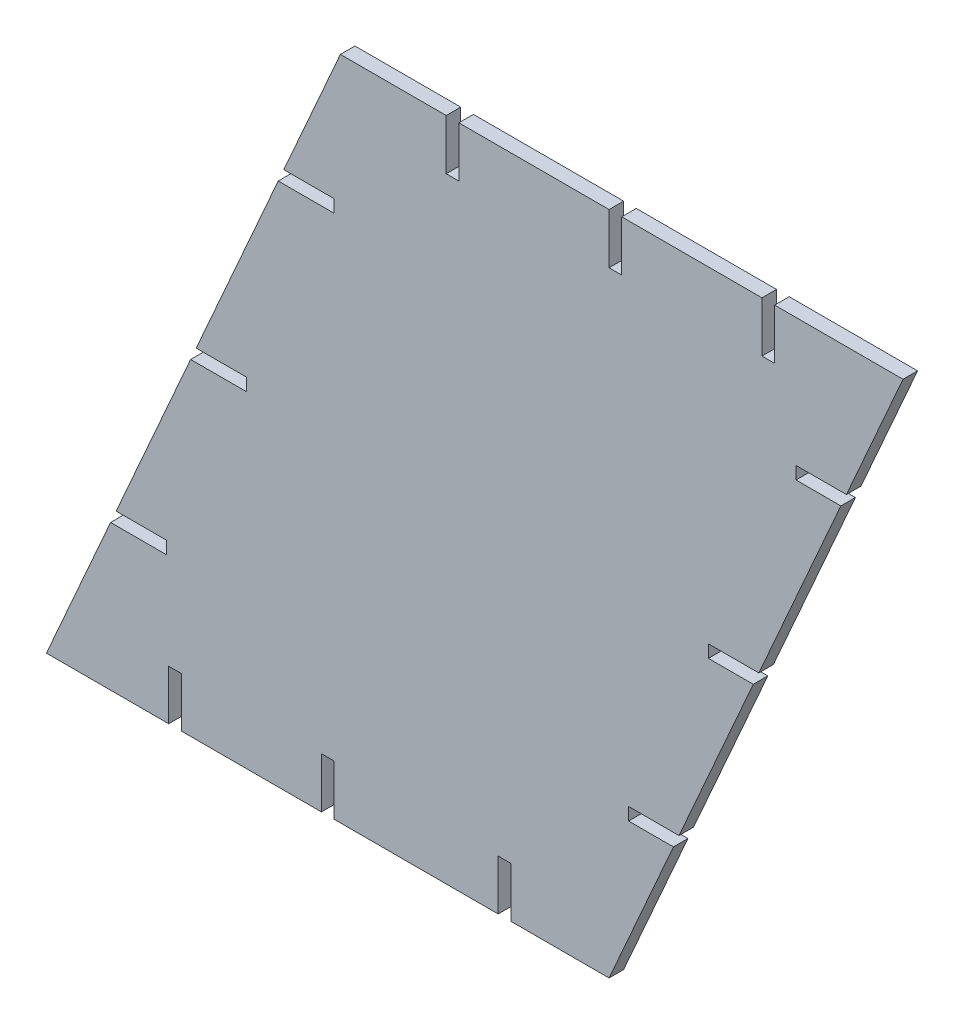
ISO-10303-21;
HEADER;
FILE_DESCRIPTION(('STEP AP214'),'2;1');
FILE_NAME('part.step','',(''),(''),'','','');
FILE_SCHEMA(('AUTOMOTIVE_DESIGN { 1 0 10303 214 1 1 1 1 }'));
ENDSEC;
DATA;
#1=APPLICATION_CONTEXT('core data for automotive mechanical design processes');
#2=APPLICATION_PROTOCOL_DEFINITION('international standard','automotive_design',2000,#1);
#3=PRODUCT_CONTEXT('',#1,'mechanical');
#4=PRODUCT('Part','Part','',(#3));
#5=PRODUCT_RELATED_PRODUCT_CATEGORY('part','',(#4));
#6=PRODUCT_DEFINITION_FORMATION('','',#4);
#7=PRODUCT_DEFINITION_CONTEXT('part definition',#1,'design');
#8=PRODUCT_DEFINITION('design','',#6,#7);
#9=PRODUCT_DEFINITION_SHAPE('','',#8);
#10=(LENGTH_UNIT() NAMED_UNIT(*) SI_UNIT(.MILLI.,.METRE.));
#11=(NAMED_UNIT(*) PLANE_ANGLE_UNIT() SI_UNIT($,.RADIAN.));
#12=(NAMED_UNIT(*) SI_UNIT($,.STERADIAN.) SOLID_ANGLE_UNIT());
#13=UNCERTAINTY_MEASURE_WITH_UNIT(LENGTH_MEASURE(1.E-05),#10,'distance_accuracy_value','');
#14=(GEOMETRIC_REPRESENTATION_CONTEXT(3) GLOBAL_UNCERTAINTY_ASSIGNED_CONTEXT((#13)) GLOBAL_UNIT_ASSIGNED_CONTEXT((#10,
#11,#12)) REPRESENTATION_CONTEXT('',''));
#15=CARTESIAN_POINT('',(0.,0.,0.));
#16=DIRECTION('',(0.,0.,1.));
#17=DIRECTION('',(1.,0.,0.));
#18=AXIS2_PLACEMENT_3D('',#15,#16,#17);
#19=CARTESIAN_POINT('',(0.,-73.9668627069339,3.));
#20=DIRECTION('',(0.,-1.,0.));
#21=DIRECTION('',(0.,0.,-1.));
#22=AXIS2_PLACEMENT_3D('',#19,#20,#21);
#23=PLANE('',#22);
#24=DIRECTION('',(-1.,0.,0.));
#25=VECTOR('',#24,1.);
#26=CARTESIAN_POINT('',(0.,-73.9668627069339,0.));
#27=LINE('',#26,#25);
#28=CARTESIAN_POINT('',(-180.969370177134,-73.9668627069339,0.));
#29=VERTEX_POINT('',#28);
#30=CARTESIAN_POINT('',(-191.367388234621,-73.9668627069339,0.));
#31=VERTEX_POINT('',#30);
#32=EDGE_CURVE('E391',#29,#31,#27,.T.);
#33=ORIENTED_EDGE('',*,*,#32,.F.);
#34=DIRECTION('',(0.,0.,-1.));
#35=VECTOR('',#34,1.);
#36=CARTESIAN_POINT('',(-180.969370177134,-73.9668627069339,3.));
#37=LINE('',#36,#35);
#38=CARTESIAN_POINT('',(-180.969370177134,-73.9668627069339,3.));
#39=VERTEX_POINT('',#38);
#40=EDGE_CURVE('E11',#39,#29,#37,.T.);
#41=ORIENTED_EDGE('',*,*,#40,.F.);
#42=DIRECTION('',(-1.,0.,0.));
#43=VECTOR('',#42,1.);
#44=CARTESIAN_POINT('',(0.,-73.9668627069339,3.));
#45=LINE('',#44,#43);
#46=CARTESIAN_POINT('',(-191.367388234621,-73.9668627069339,3.));
#47=VERTEX_POINT('',#46);
#48=EDGE_CURVE('E534',#39,#47,#45,.T.);
#49=ORIENTED_EDGE('',*,*,#48,.T.);
#50=DIRECTION('',(0.,0.,-1.));
#51=VECTOR('',#50,1.);
#52=CARTESIAN_POINT('',(-191.367388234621,-73.9668627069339,3.));
#53=LINE('',#52,#51);
#54=EDGE_CURVE('E218',#47,#31,#53,.T.);
#55=ORIENTED_EDGE('',*,*,#54,.T.);
#56=EDGE_LOOP('',(#33,#41,#49,#55));
#57=FACE_BOUND('',#56,.T.);
#58=ADVANCED_FACE('F35',(#57),#23,.T.);
#59=CARTESIAN_POINT('',(-180.969370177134,0.,3.));
#60=DIRECTION('',(1.,0.,0.));
#61=DIRECTION('',(0.,0.,-1.));
#62=AXIS2_PLACEMENT_3D('',#59,#60,#61);
#63=PLANE('',#62);
#64=DIRECTION('',(0.,-1.,0.));
#65=VECTOR('',#64,1.);
#66=CARTESIAN_POINT('',(-180.969370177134,0.,0.));
#67=LINE('',#66,#65);
#68=CARTESIAN_POINT('',(-180.969370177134,-76.5668627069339,0.));
#69=VERTEX_POINT('',#68);
#70=EDGE_CURVE('E394',#29,#69,#67,.T.);
#71=ORIENTED_EDGE('',*,*,#70,.T.);
#72=DIRECTION('',(0.,0.,-1.));
#73=VECTOR('',#72,1.);
#74=CARTESIAN_POINT('',(-180.969370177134,-76.5668627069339,3.));
#75=LINE('',#74,#73);
#76=CARTESIAN_POINT('',(-180.969370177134,-76.5668627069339,3.));
#77=VERTEX_POINT('',#76);
#78=EDGE_CURVE('E43',#77,#69,#75,.T.);
#79=ORIENTED_EDGE('',*,*,#78,.F.);
#80=DIRECTION('',(0.,-1.,0.));
#81=VECTOR('',#80,1.);
#82=CARTESIAN_POINT('',(-180.969370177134,0.,3.));
#83=LINE('',#82,#81);
#84=EDGE_CURVE('E785',#39,#77,#83,.T.);
#85=ORIENTED_EDGE('',*,*,#84,.F.);
#86=ORIENTED_EDGE('',*,*,#40,.T.);
#87=EDGE_LOOP('',(#71,#79,#85,#86));
#88=FACE_BOUND('',#87,.T.);
#89=ADVANCED_FACE('F788',(#88),#63,.F.);
#90=CARTESIAN_POINT('',(0.,-76.5668627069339,3.));
#91=DIRECTION('',(0.,-1.,0.));
#92=DIRECTION('',(0.,0.,-1.));
#93=AXIS2_PLACEMENT_3D('',#90,#91,#92);
#94=PLANE('',#93);
#95=DIRECTION('',(-1.,0.,0.));
#96=VECTOR('',#95,1.);
#97=CARTESIAN_POINT('',(0.,-76.5668627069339,0.));
#98=LINE('',#97,#96);
#99=CARTESIAN_POINT('',(-192.51585449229,-76.5668627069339,0.));
#100=VERTEX_POINT('',#99);
#101=EDGE_CURVE('E396',#69,#100,#98,.T.);
#102=ORIENTED_EDGE('',*,*,#101,.T.);
#103=DIRECTION('',(0.,0.,-1.));
#104=VECTOR('',#103,1.);
#105=CARTESIAN_POINT('',(-192.51585449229,-76.5668627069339,3.));
#106=LINE('',#105,#104);
#107=CARTESIAN_POINT('',(-192.51585449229,-76.5668627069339,3.));
#108=VERTEX_POINT('',#107);
#109=EDGE_CURVE('E634',#108,#100,#106,.T.);
#110=ORIENTED_EDGE('',*,*,#109,.F.);
#111=DIRECTION('',(-1.,0.,0.));
#112=VECTOR('',#111,1.);
#113=CARTESIAN_POINT('',(0.,-76.5668627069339,3.));
#114=LINE('',#113,#112);
#115=EDGE_CURVE('E643',#77,#108,#114,.T.);
#116=ORIENTED_EDGE('',*,*,#115,.F.);
#117=ORIENTED_EDGE('',*,*,#78,.T.);
#118=EDGE_LOOP('',(#102,#110,#116,#117));
#119=FACE_BOUND('',#118,.T.);
#120=ADVANCED_FACE('F641',(#119),#94,.F.);
#121=CARTESIAN_POINT('',(-132.786352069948,58.6540941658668,3.));
#122=DIRECTION('',(0.914734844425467,-0.404054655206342,0.));
#123=DIRECTION('',(0.404054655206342,0.914734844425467,0.));
#124=AXIS2_PLACEMENT_3D('',#121,#122,#123);
#125=PLANE('',#124);
#126=DIRECTION('',(-0.404054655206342,-0.914734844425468,0.));
#127=VECTOR('',#126,1.);
#128=CARTESIAN_POINT('',(-132.786352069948,58.6540941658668,0.));
#129=LINE('',#128,#127);
#130=CARTESIAN_POINT('',(-205.746285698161,-106.519088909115,0.));
#131=VERTEX_POINT('',#130);
#132=EDGE_CURVE('E398',#100,#131,#129,.T.);
#133=ORIENTED_EDGE('',*,*,#132,.T.);
#134=DIRECTION('',(0.,0.,-1.));
#135=VECTOR('',#134,1.);
#136=CARTESIAN_POINT('',(-205.746285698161,-106.519088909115,3.));
#137=LINE('',#136,#135);
#138=CARTESIAN_POINT('',(-205.746285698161,-106.519088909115,3.));
#139=VERTEX_POINT('',#138);
#140=EDGE_CURVE('E631',#139,#131,#137,.T.);
#141=ORIENTED_EDGE('',*,*,#140,.F.);
#142=DIRECTION('',(-0.404054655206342,-0.914734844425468,0.));
#143=VECTOR('',#142,1.);
#144=CARTESIAN_POINT('',(-132.786352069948,58.6540941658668,3.));
#145=LINE('',#144,#143);
#146=EDGE_CURVE('E662',#108,#139,#145,.T.);
#147=ORIENTED_EDGE('',*,*,#146,.F.);
#148=ORIENTED_EDGE('',*,*,#109,.T.);
#149=EDGE_LOOP('',(#133,#141,#147,#148));
#150=FACE_BOUND('',#149,.T.);
#151=ADVANCED_FACE('F652',(#150),#125,.F.);
#152=CARTESIAN_POINT('',(0.,-106.519088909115,3.));
#153=DIRECTION('',(0.,1.,0.));
#154=DIRECTION('',(0.,0.,1.));
#155=AXIS2_PLACEMENT_3D('',#152,#153,#154);
#156=PLANE('',#155);
#157=DIRECTION('',(1.,0.,0.));
#158=VECTOR('',#157,1.);
#159=CARTESIAN_POINT('',(0.,-106.519088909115,0.));
#160=LINE('',#159,#158);
#161=CARTESIAN_POINT('',(-180.529913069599,-106.519088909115,0.));
#162=VERTEX_POINT('',#161);
#163=EDGE_CURVE('E400',#131,#162,#160,.T.);
#164=ORIENTED_EDGE('',*,*,#163,.T.);
#165=DIRECTION('',(0.,0.,-1.));
#166=VECTOR('',#165,1.);
#167=CARTESIAN_POINT('',(-180.529913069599,-106.519088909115,3.));
#168=LINE('',#167,#166);
#169=CARTESIAN_POINT('',(-180.529913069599,-106.519088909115,3.));
#170=VERTEX_POINT('',#169);
#171=EDGE_CURVE('E629',#170,#162,#168,.T.);
#172=ORIENTED_EDGE('',*,*,#171,.F.);
#173=DIRECTION('',(1.,0.,0.));
#174=VECTOR('',#173,1.);
#175=CARTESIAN_POINT('',(0.,-106.519088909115,3.));
#176=LINE('',#175,#174);
#177=EDGE_CURVE('E658',#139,#170,#176,.T.);
#178=ORIENTED_EDGE('',*,*,#177,.F.);
#179=ORIENTED_EDGE('',*,*,#140,.T.);
#180=EDGE_LOOP('',(#164,#172,#178,#179));
#181=FACE_BOUND('',#180,.T.);
#182=ADVANCED_FACE('F656',(#181),#156,.F.);
#183=CARTESIAN_POINT('',(-180.529913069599,0.,3.));
#184=DIRECTION('',(1.,0.,0.));
#185=DIRECTION('',(0.,0.,-1.));
#186=AXIS2_PLACEMENT_3D('',#183,#184,#185);
#187=PLANE('',#186);
#188=DIRECTION('',(0.,-1.,0.));
#189=VECTOR('',#188,1.);
#190=CARTESIAN_POINT('',(-180.529913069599,0.,0.));
#191=LINE('',#190,#189);
#192=CARTESIAN_POINT('',(-180.529913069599,-96.2435466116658,0.));
#193=VERTEX_POINT('',#192);
#194=EDGE_CURVE('E403',#193,#162,#191,.T.);
#195=ORIENTED_EDGE('',*,*,#194,.F.);
#196=DIRECTION('',(0.,0.,-1.));
#197=VECTOR('',#196,1.);
#198=CARTESIAN_POINT('',(-180.529913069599,-96.2435466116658,3.));
#199=LINE('',#198,#197);
#200=CARTESIAN_POINT('',(-180.529913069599,-96.2435466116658,3.));
#201=VERTEX_POINT('',#200);
#202=EDGE_CURVE('E627',#201,#193,#199,.T.);
#203=ORIENTED_EDGE('',*,*,#202,.F.);
#204=DIRECTION('',(0.,-1.,0.));
#205=VECTOR('',#204,1.);
#206=CARTESIAN_POINT('',(-180.529913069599,0.,3.));
#207=LINE('',#206,#205);
#208=EDGE_CURVE('E661',#201,#170,#207,.T.);
#209=ORIENTED_EDGE('',*,*,#208,.T.);
#210=ORIENTED_EDGE('',*,*,#171,.T.);
#211=EDGE_LOOP('',(#195,#203,#209,#210));
#212=FACE_BOUND('',#211,.T.);
#213=ADVANCED_FACE('F800',(#212),#187,.T.);
#214=CARTESIAN_POINT('',(0.,-96.2435466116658,3.));
#215=DIRECTION('',(0.,-1.,0.));
#216=DIRECTION('',(0.,0.,-1.));
#217=AXIS2_PLACEMENT_3D('',#214,#215,#216);
#218=PLANE('',#217);
#219=DIRECTION('',(-1.,0.,0.));
#220=VECTOR('',#219,1.);
#221=CARTESIAN_POINT('',(0.,-96.2435466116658,0.));
#222=LINE('',#221,#220);
#223=CARTESIAN_POINT('',(-177.929913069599,-96.2435466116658,0.));
#224=VERTEX_POINT('',#223);
#225=EDGE_CURVE('E406',#224,#193,#222,.T.);
#226=ORIENTED_EDGE('',*,*,#225,.F.);
#227=DIRECTION('',(0.,0.,-1.));
#228=VECTOR('',#227,1.);
#229=CARTESIAN_POINT('',(-177.929913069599,-96.2435466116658,3.));
#230=LINE('',#229,#228);
#231=CARTESIAN_POINT('',(-177.929913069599,-96.2435466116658,3.));
#232=VERTEX_POINT('',#231);
#233=EDGE_CURVE('E625',#232,#224,#230,.T.);
#234=ORIENTED_EDGE('',*,*,#233,.F.);
#235=DIRECTION('',(-1.,0.,0.));
#236=VECTOR('',#235,1.);
#237=CARTESIAN_POINT('',(0.,-96.2435466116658,3.));
#238=LINE('',#237,#236);
#239=EDGE_CURVE('E664',#232,#201,#238,.T.);
#240=ORIENTED_EDGE('',*,*,#239,.T.);
#241=ORIENTED_EDGE('',*,*,#202,.T.);
#242=EDGE_LOOP('',(#226,#234,#240,#241));
#243=FACE_BOUND('',#242,.T.);
#244=ADVANCED_FACE('F803',(#243),#218,.T.);
#245=CARTESIAN_POINT('',(-177.929913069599,0.,3.));
#246=DIRECTION('',(1.,0.,0.));
#247=DIRECTION('',(0.,0.,-1.));
#248=AXIS2_PLACEMENT_3D('',#245,#246,#247);
#249=PLANE('',#248);
#250=DIRECTION('',(0.,-1.,0.));
#251=VECTOR('',#250,1.);
#252=CARTESIAN_POINT('',(-177.929913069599,0.,0.));
#253=LINE('',#252,#251);
#254=CARTESIAN_POINT('',(-177.929913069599,-106.519088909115,0.));
#255=VERTEX_POINT('',#254);
#256=EDGE_CURVE('E409',#224,#255,#253,.T.);
#257=ORIENTED_EDGE('',*,*,#256,.T.);
#258=DIRECTION('',(0.,0.,-1.));
#259=VECTOR('',#258,1.);
#260=CARTESIAN_POINT('',(-177.929913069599,-106.519088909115,3.));
#261=LINE('',#260,#259);
#262=CARTESIAN_POINT('',(-177.929913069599,-106.519088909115,3.));
#263=VERTEX_POINT('',#262);
#264=EDGE_CURVE('E622',#263,#255,#261,.T.);
#265=ORIENTED_EDGE('',*,*,#264,.F.);
#266=DIRECTION('',(0.,-1.,0.));
#267=VECTOR('',#266,1.);
#268=CARTESIAN_POINT('',(-177.929913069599,0.,3.));
#269=LINE('',#268,#267);
#270=EDGE_CURVE('E671',#232,#263,#269,.T.);
#271=ORIENTED_EDGE('',*,*,#270,.F.);
#272=ORIENTED_EDGE('',*,*,#233,.T.);
#273=EDGE_LOOP('',(#257,#265,#271,#272));
#274=FACE_BOUND('',#273,.T.);
#275=ADVANCED_FACE('F807',(#274),#249,.F.);
#276=CARTESIAN_POINT('',(0.,-106.519088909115,3.));
#277=DIRECTION('',(0.,1.,0.));
#278=DIRECTION('',(0.,0.,1.));
#279=AXIS2_PLACEMENT_3D('',#276,#277,#278);
#280=PLANE('',#279);
#281=DIRECTION('',(1.,0.,0.));
#282=VECTOR('',#281,1.);
#283=CARTESIAN_POINT('',(0.,-106.519088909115,0.));
#284=LINE('',#283,#282);
#285=CARTESIAN_POINT('',(-149.045582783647,-106.519088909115,0.));
#286=VERTEX_POINT('',#285);
#287=EDGE_CURVE('E411',#255,#286,#284,.T.);
#288=ORIENTED_EDGE('',*,*,#287,.T.);
#289=DIRECTION('',(0.,0.,-1.));
#290=VECTOR('',#289,1.);
#291=CARTESIAN_POINT('',(-149.045582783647,-106.519088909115,3.));
#292=LINE('',#291,#290);
#293=CARTESIAN_POINT('',(-149.045582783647,-106.519088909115,3.));
#294=VERTEX_POINT('',#293);
#295=EDGE_CURVE('E620',#294,#286,#292,.T.);
#296=ORIENTED_EDGE('',*,*,#295,.F.);
#297=DIRECTION('',(1.,0.,0.));
#298=VECTOR('',#297,1.);
#299=CARTESIAN_POINT('',(0.,-106.519088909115,3.));
#300=LINE('',#299,#298);
#301=EDGE_CURVE('E673',#263,#294,#300,.T.);
#302=ORIENTED_EDGE('',*,*,#301,.F.);
#303=ORIENTED_EDGE('',*,*,#264,.T.);
#304=EDGE_LOOP('',(#288,#296,#302,#303));
#305=FACE_BOUND('',#304,.T.);
#306=ADVANCED_FACE('F811',(#305),#280,.F.);
#307=CARTESIAN_POINT('',(-149.045582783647,0.,3.));
#308=DIRECTION('',(1.,0.,0.));
#309=DIRECTION('',(0.,0.,-1.));
#310=AXIS2_PLACEMENT_3D('',#307,#308,#309);
#311=PLANE('',#310);
#312=DIRECTION('',(0.,-1.,0.));
#313=VECTOR('',#312,1.);
#314=CARTESIAN_POINT('',(-149.045582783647,0.,0.));
#315=LINE('',#314,#313);
#316=CARTESIAN_POINT('',(-149.045582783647,-96.1190889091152,0.));
#317=VERTEX_POINT('',#316);
#318=EDGE_CURVE('E414',#317,#286,#315,.T.);
#319=ORIENTED_EDGE('',*,*,#318,.F.);
#320=DIRECTION('',(0.,0.,-1.));
#321=VECTOR('',#320,1.);
#322=CARTESIAN_POINT('',(-149.045582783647,-96.1190889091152,3.));
#323=LINE('',#322,#321);
#324=CARTESIAN_POINT('',(-149.045582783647,-96.1190889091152,3.));
#325=VERTEX_POINT('',#324);
#326=EDGE_CURVE('E618',#325,#317,#323,.T.);
#327=ORIENTED_EDGE('',*,*,#326,.F.);
#328=DIRECTION('',(0.,-1.,0.));
#329=VECTOR('',#328,1.);
#330=CARTESIAN_POINT('',(-149.045582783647,0.,3.));
#331=LINE('',#330,#329);
#332=EDGE_CURVE('E675',#325,#294,#331,.T.);
#333=ORIENTED_EDGE('',*,*,#332,.T.);
#334=ORIENTED_EDGE('',*,*,#295,.T.);
#335=EDGE_LOOP('',(#319,#327,#333,#334));
#336=FACE_BOUND('',#335,.T.);
#337=ADVANCED_FACE('F815',(#336),#311,.T.);
#338=CARTESIAN_POINT('',(0.,-96.1190889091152,3.));
#339=DIRECTION('',(0.,-1.,0.));
#340=DIRECTION('',(0.,0.,-1.));
#341=AXIS2_PLACEMENT_3D('',#338,#339,#340);
#342=PLANE('',#341);
#343=DIRECTION('',(-1.,0.,0.));
#344=VECTOR('',#343,1.);
#345=CARTESIAN_POINT('',(0.,-96.1190889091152,0.));
#346=LINE('',#345,#344);
#347=CARTESIAN_POINT('',(-146.445582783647,-96.1190889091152,0.));
#348=VERTEX_POINT('',#347);
#349=EDGE_CURVE('E417',#348,#317,#346,.T.);
#350=ORIENTED_EDGE('',*,*,#349,.F.);
#351=DIRECTION('',(0.,0.,-1.));
#352=VECTOR('',#351,1.);
#353=CARTESIAN_POINT('',(-146.445582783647,-96.1190889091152,3.));
#354=LINE('',#353,#352);
#355=CARTESIAN_POINT('',(-146.445582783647,-96.1190889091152,3.));
#356=VERTEX_POINT('',#355);
#357=EDGE_CURVE('E616',#356,#348,#354,.T.);
#358=ORIENTED_EDGE('',*,*,#357,.F.);
#359=DIRECTION('',(-1.,0.,0.));
#360=VECTOR('',#359,1.);
#361=CARTESIAN_POINT('',(0.,-96.1190889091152,3.));
#362=LINE('',#361,#360);
#363=EDGE_CURVE('E678',#356,#325,#362,.T.);
#364=ORIENTED_EDGE('',*,*,#363,.T.);
#365=ORIENTED_EDGE('',*,*,#326,.T.);
#366=EDGE_LOOP('',(#350,#358,#364,#365));
#367=FACE_BOUND('',#366,.T.);
#368=ADVANCED_FACE('F819',(#367),#342,.T.);
#369=CARTESIAN_POINT('',(-146.445582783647,0.,3.));
#370=DIRECTION('',(1.,0.,0.));
#371=DIRECTION('',(0.,0.,-1.));
#372=AXIS2_PLACEMENT_3D('',#369,#370,#371);
#373=PLANE('',#372);
#374=DIRECTION('',(0.,-1.,0.));
#375=VECTOR('',#374,1.);
#376=CARTESIAN_POINT('',(-146.445582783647,0.,0.));
#377=LINE('',#376,#375);
#378=CARTESIAN_POINT('',(-146.445582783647,-106.519088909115,0.));
#379=VERTEX_POINT('',#378);
#380=EDGE_CURVE('E420',#348,#379,#377,.T.);
#381=ORIENTED_EDGE('',*,*,#380,.T.);
#382=DIRECTION('',(0.,0.,-1.));
#383=VECTOR('',#382,1.);
#384=CARTESIAN_POINT('',(-146.445582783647,-106.519088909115,3.));
#385=LINE('',#384,#383);
#386=CARTESIAN_POINT('',(-146.445582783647,-106.519088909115,3.));
#387=VERTEX_POINT('',#386);
#388=EDGE_CURVE('E613',#387,#379,#385,.T.);
#389=ORIENTED_EDGE('',*,*,#388,.F.);
#390=DIRECTION('',(0.,-1.,0.));
#391=VECTOR('',#390,1.);
#392=CARTESIAN_POINT('',(-146.445582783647,0.,3.));
#393=LINE('',#392,#391);
#394=EDGE_CURVE('E681',#356,#387,#393,.T.);
#395=ORIENTED_EDGE('',*,*,#394,.F.);
#396=ORIENTED_EDGE('',*,*,#357,.T.);
#397=EDGE_LOOP('',(#381,#389,#395,#396));
#398=FACE_BOUND('',#397,.T.);
#399=ADVANCED_FACE('F823',(#398),#373,.F.);
#400=CARTESIAN_POINT('',(0.,-106.519088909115,3.));
#401=DIRECTION('',(0.,1.,0.));
#402=DIRECTION('',(0.,0.,1.));
#403=AXIS2_PLACEMENT_3D('',#400,#401,#402);
#404=PLANE('',#403);
#405=DIRECTION('',(1.,0.,0.));
#406=VECTOR('',#405,1.);
#407=CARTESIAN_POINT('',(0.,-106.519088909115,0.));
#408=LINE('',#407,#406);
#409=CARTESIAN_POINT('',(-112.602220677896,-106.519088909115,0.));
#410=VERTEX_POINT('',#409);
#411=EDGE_CURVE('E422',#379,#410,#408,.T.);
#412=ORIENTED_EDGE('',*,*,#411,.T.);
#413=DIRECTION('',(0.,0.,-1.));
#414=VECTOR('',#413,1.);
#415=CARTESIAN_POINT('',(-112.602220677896,-106.519088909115,3.));
#416=LINE('',#415,#414);
#417=CARTESIAN_POINT('',(-112.602220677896,-106.519088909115,3.));
#418=VERTEX_POINT('',#417);
#419=EDGE_CURVE('E611',#418,#410,#416,.T.);
#420=ORIENTED_EDGE('',*,*,#419,.F.);
#421=DIRECTION('',(1.,0.,0.));
#422=VECTOR('',#421,1.);
#423=CARTESIAN_POINT('',(0.,-106.519088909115,3.));
#424=LINE('',#423,#422);
#425=EDGE_CURVE('E683',#387,#418,#424,.T.);
#426=ORIENTED_EDGE('',*,*,#425,.F.);
#427=ORIENTED_EDGE('',*,*,#388,.T.);
#428=EDGE_LOOP('',(#412,#420,#426,#427));
#429=FACE_BOUND('',#428,.T.);
#430=ADVANCED_FACE('F827',(#429),#404,.F.);
#431=CARTESIAN_POINT('',(-112.602220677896,0.,3.));
#432=DIRECTION('',(1.,0.,0.));
#433=DIRECTION('',(0.,0.,-1.));
#434=AXIS2_PLACEMENT_3D('',#431,#432,#433);
#435=PLANE('',#434);
#436=DIRECTION('',(0.,-1.,0.));
#437=VECTOR('',#436,1.);
#438=CARTESIAN_POINT('',(-112.602220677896,0.,0.));
#439=LINE('',#438,#437);
#440=CARTESIAN_POINT('',(-112.602220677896,-96.1739768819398,0.));
#441=VERTEX_POINT('',#440);
#442=EDGE_CURVE('E425',#441,#410,#439,.T.);
#443=ORIENTED_EDGE('',*,*,#442,.F.);
#444=DIRECTION('',(0.,0.,-1.));
#445=VECTOR('',#444,1.);
#446=CARTESIAN_POINT('',(-112.602220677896,-96.1739768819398,3.));
#447=LINE('',#446,#445);
#448=CARTESIAN_POINT('',(-112.602220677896,-96.1739768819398,3.));
#449=VERTEX_POINT('',#448);
#450=EDGE_CURVE('E609',#449,#441,#447,.T.);
#451=ORIENTED_EDGE('',*,*,#450,.F.);
#452=DIRECTION('',(0.,-1.,0.));
#453=VECTOR('',#452,1.);
#454=CARTESIAN_POINT('',(-112.602220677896,0.,3.));
#455=LINE('',#454,#453);
#456=EDGE_CURVE('E685',#449,#418,#455,.T.);
#457=ORIENTED_EDGE('',*,*,#456,.T.);
#458=ORIENTED_EDGE('',*,*,#419,.T.);
#459=EDGE_LOOP('',(#443,#451,#457,#458));
#460=FACE_BOUND('',#459,.T.);
#461=ADVANCED_FACE('F831',(#460),#435,.T.);
#462=CARTESIAN_POINT('',(0.,-96.1739768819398,3.));
#463=DIRECTION('',(0.,-1.,0.));
#464=DIRECTION('',(0.,0.,-1.));
#465=AXIS2_PLACEMENT_3D('',#462,#463,#464);
#466=PLANE('',#465);
#467=DIRECTION('',(-1.,0.,0.));
#468=VECTOR('',#467,1.);
#469=CARTESIAN_POINT('',(0.,-96.1739768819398,0.));
#470=LINE('',#469,#468);
#471=CARTESIAN_POINT('',(-110.002220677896,-96.1739768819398,0.));
#472=VERTEX_POINT('',#471);
#473=EDGE_CURVE('E428',#472,#441,#470,.T.);
#474=ORIENTED_EDGE('',*,*,#473,.F.);
#475=DIRECTION('',(0.,0.,-1.));
#476=VECTOR('',#475,1.);
#477=CARTESIAN_POINT('',(-110.002220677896,-96.1739768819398,3.));
#478=LINE('',#477,#476);
#479=CARTESIAN_POINT('',(-110.002220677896,-96.1739768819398,3.));
#480=VERTEX_POINT('',#479);
#481=EDGE_CURVE('E607',#480,#472,#478,.T.);
#482=ORIENTED_EDGE('',*,*,#481,.F.);
#483=DIRECTION('',(-1.,0.,0.));
#484=VECTOR('',#483,1.);
#485=CARTESIAN_POINT('',(0.,-96.1739768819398,3.));
#486=LINE('',#485,#484);
#487=EDGE_CURVE('E688',#480,#449,#486,.T.);
#488=ORIENTED_EDGE('',*,*,#487,.T.);
#489=ORIENTED_EDGE('',*,*,#450,.T.);
#490=EDGE_LOOP('',(#474,#482,#488,#489));
#491=FACE_BOUND('',#490,.T.);
#492=ADVANCED_FACE('F835',(#491),#466,.T.);
#493=CARTESIAN_POINT('',(-110.002220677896,0.,3.));
#494=DIRECTION('',(1.,0.,0.));
#495=DIRECTION('',(0.,0.,-1.));
#496=AXIS2_PLACEMENT_3D('',#493,#494,#495);
#497=PLANE('',#496);
#498=DIRECTION('',(0.,-1.,0.));
#499=VECTOR('',#498,1.);
#500=CARTESIAN_POINT('',(-110.002220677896,0.,0.));
#501=LINE('',#500,#499);
#502=CARTESIAN_POINT('',(-110.002220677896,-106.519088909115,0.));
#503=VERTEX_POINT('',#502);
#504=EDGE_CURVE('E431',#472,#503,#501,.T.);
#505=ORIENTED_EDGE('',*,*,#504,.T.);
#506=DIRECTION('',(0.,0.,-1.));
#507=VECTOR('',#506,1.);
#508=CARTESIAN_POINT('',(-110.002220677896,-106.519088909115,3.));
#509=LINE('',#508,#507);
#510=CARTESIAN_POINT('',(-110.002220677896,-106.519088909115,3.));
#511=VERTEX_POINT('',#510);
#512=EDGE_CURVE('E604',#511,#503,#509,.T.);
#513=ORIENTED_EDGE('',*,*,#512,.F.);
#514=DIRECTION('',(0.,-1.,0.));
#515=VECTOR('',#514,1.);
#516=CARTESIAN_POINT('',(-110.002220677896,0.,3.));
#517=LINE('',#516,#515);
#518=EDGE_CURVE('E691',#480,#511,#517,.T.);
#519=ORIENTED_EDGE('',*,*,#518,.F.);
#520=ORIENTED_EDGE('',*,*,#481,.T.);
#521=EDGE_LOOP('',(#505,#513,#519,#520));
#522=FACE_BOUND('',#521,.T.);
#523=ADVANCED_FACE('F839',(#522),#497,.F.);
#524=CARTESIAN_POINT('',(0.,-106.519088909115,3.));
#525=DIRECTION('',(0.,1.,0.));
#526=DIRECTION('',(0.,0.,1.));
#527=AXIS2_PLACEMENT_3D('',#524,#525,#526);
#528=PLANE('',#527);
#529=DIRECTION('',(1.,0.,0.));
#530=VECTOR('',#529,1.);
#531=CARTESIAN_POINT('',(0.,-106.519088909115,0.));
#532=LINE('',#531,#530);
#533=CARTESIAN_POINT('',(-89.7462856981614,-106.519088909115,0.));
#534=VERTEX_POINT('',#533);
#535=EDGE_CURVE('E433',#503,#534,#532,.T.);
#536=ORIENTED_EDGE('',*,*,#535,.T.);
#537=DIRECTION('',(0.,0.,-1.));
#538=VECTOR('',#537,1.);
#539=CARTESIAN_POINT('',(-89.7462856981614,-106.519088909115,3.));
#540=LINE('',#539,#538);
#541=CARTESIAN_POINT('',(-89.7462856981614,-106.519088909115,3.));
#542=VERTEX_POINT('',#541);
#543=EDGE_CURVE('E602',#542,#534,#540,.T.);
#544=ORIENTED_EDGE('',*,*,#543,.F.);
#545=DIRECTION('',(1.,0.,0.));
#546=VECTOR('',#545,1.);
#547=CARTESIAN_POINT('',(0.,-106.519088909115,3.));
#548=LINE('',#547,#546);
#549=EDGE_CURVE('E693',#511,#542,#548,.T.);
#550=ORIENTED_EDGE('',*,*,#549,.F.);
#551=ORIENTED_EDGE('',*,*,#512,.T.);
#552=EDGE_LOOP('',(#536,#544,#550,#551));
#553=FACE_BOUND('',#552,.T.);
#554=ADVANCED_FACE('F843',(#553),#528,.F.);
#555=CARTESIAN_POINT('',(-35.7245311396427,15.780160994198,3.));
#556=DIRECTION('',(0.914734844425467,-0.404054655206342,0.));
#557=DIRECTION('',(0.404054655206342,0.914734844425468,0.));
#558=AXIS2_PLACEMENT_3D('',#555,#556,#557);
#559=PLANE('',#558);
#560=DIRECTION('',(-0.404054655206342,-0.914734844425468,0.));
#561=VECTOR('',#560,1.);
#562=CARTESIAN_POINT('',(-35.7245311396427,15.780160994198,0.));
#563=LINE('',#562,#561);
#564=CARTESIAN_POINT('',(-76.4778338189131,-76.4807881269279,0.));
#565=VERTEX_POINT('',#564);
#566=EDGE_CURVE('E436',#565,#534,#563,.T.);
#567=ORIENTED_EDGE('',*,*,#566,.F.);
#568=DIRECTION('',(0.,0.,-1.));
#569=VECTOR('',#568,1.);
#570=CARTESIAN_POINT('',(-76.4778338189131,-76.4807881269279,3.));
#571=LINE('',#570,#569);
#572=CARTESIAN_POINT('',(-76.4778338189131,-76.4807881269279,3.));
#573=VERTEX_POINT('',#572);
#574=EDGE_CURVE('E600',#573,#565,#571,.T.);
#575=ORIENTED_EDGE('',*,*,#574,.F.);
#576=DIRECTION('',(-0.404054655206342,-0.914734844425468,0.));
#577=VECTOR('',#576,1.);
#578=CARTESIAN_POINT('',(-35.7245311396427,15.780160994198,3.));
#579=LINE('',#578,#577);
#580=EDGE_CURVE('E695',#573,#542,#579,.T.);
#581=ORIENTED_EDGE('',*,*,#580,.T.);
#582=ORIENTED_EDGE('',*,*,#543,.T.);
#583=EDGE_LOOP('',(#567,#575,#581,#582));
#584=FACE_BOUND('',#583,.T.);
#585=ADVANCED_FACE('F847',(#584),#559,.T.);
#586=CARTESIAN_POINT('',(0.,-76.4807881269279,3.));
#587=DIRECTION('',(0.,1.,0.));
#588=DIRECTION('',(0.,0.,1.));
#589=AXIS2_PLACEMENT_3D('',#586,#587,#588);
#590=PLANE('',#589);
#591=DIRECTION('',(1.,0.,0.));
#592=VECTOR('',#591,1.);
#593=CARTESIAN_POINT('',(0.,-76.4807881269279,0.));
#594=LINE('',#593,#592);
#595=CARTESIAN_POINT('',(-85.7201498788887,-76.4807881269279,0.));
#596=VERTEX_POINT('',#595);
#597=EDGE_CURVE('E439',#596,#565,#594,.T.);
#598=ORIENTED_EDGE('',*,*,#597,.F.);
#599=DIRECTION('',(0.,0.,-1.));
#600=VECTOR('',#599,1.);
#601=CARTESIAN_POINT('',(-85.7201498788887,-76.4807881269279,3.));
#602=LINE('',#601,#600);
#603=CARTESIAN_POINT('',(-85.7201498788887,-76.4807881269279,3.));
#604=VERTEX_POINT('',#603);
#605=EDGE_CURVE('E598',#604,#596,#602,.T.);
#606=ORIENTED_EDGE('',*,*,#605,.F.);
#607=DIRECTION('',(1.,0.,0.));
#608=VECTOR('',#607,1.);
#609=CARTESIAN_POINT('',(0.,-76.4807881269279,3.));
#610=LINE('',#609,#608);
#611=EDGE_CURVE('E698',#604,#573,#610,.T.);
#612=ORIENTED_EDGE('',*,*,#611,.T.);
#613=ORIENTED_EDGE('',*,*,#574,.T.);
#614=EDGE_LOOP('',(#598,#606,#612,#613));
#615=FACE_BOUND('',#614,.T.);
#616=ADVANCED_FACE('F851',(#615),#590,.T.);
#617=CARTESIAN_POINT('',(-85.7201498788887,0.,3.));
#618=DIRECTION('',(1.,0.,0.));
#619=DIRECTION('',(0.,0.,-1.));
#620=AXIS2_PLACEMENT_3D('',#617,#618,#619);
#621=PLANE('',#620);
#622=DIRECTION('',(0.,-1.,0.));
#623=VECTOR('',#622,1.);
#624=CARTESIAN_POINT('',(-85.7201498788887,0.,0.));
#625=LINE('',#624,#623);
#626=CARTESIAN_POINT('',(-85.7201498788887,-73.8807881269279,0.));
#627=VERTEX_POINT('',#626);
#628=EDGE_CURVE('E442',#627,#596,#625,.T.);
#629=ORIENTED_EDGE('',*,*,#628,.F.);
#630=DIRECTION('',(0.,0.,-1.));
#631=VECTOR('',#630,1.);
#632=CARTESIAN_POINT('',(-85.7201498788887,-73.8807881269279,3.));
#633=LINE('',#632,#631);
#634=CARTESIAN_POINT('',(-85.7201498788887,-73.8807881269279,3.));
#635=VERTEX_POINT('',#634);
#636=EDGE_CURVE('E596',#635,#627,#633,.T.);
#637=ORIENTED_EDGE('',*,*,#636,.F.);
#638=DIRECTION('',(0.,-1.,0.));
#639=VECTOR('',#638,1.);
#640=CARTESIAN_POINT('',(-85.7201498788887,0.,3.));
#641=LINE('',#640,#639);
#642=EDGE_CURVE('E701',#635,#604,#641,.T.);
#643=ORIENTED_EDGE('',*,*,#642,.T.);
#644=ORIENTED_EDGE('',*,*,#605,.T.);
#645=EDGE_LOOP('',(#629,#637,#643,#644));
#646=FACE_BOUND('',#645,.T.);
#647=ADVANCED_FACE('F855',(#646),#621,.T.);
#648=CARTESIAN_POINT('',(0.,-73.8807881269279,3.));
#649=DIRECTION('',(0.,1.,0.));
#650=DIRECTION('',(0.,0.,1.));
#651=AXIS2_PLACEMENT_3D('',#648,#649,#650);
#652=PLANE('',#651);
#653=DIRECTION('',(1.,0.,0.));
#654=VECTOR('',#653,1.);
#655=CARTESIAN_POINT('',(0.,-73.8807881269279,0.));
#656=LINE('',#655,#654);
#657=CARTESIAN_POINT('',(-75.3293675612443,-73.8807881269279,0.));
#658=VERTEX_POINT('',#657);
#659=EDGE_CURVE('E445',#627,#658,#656,.T.);
#660=ORIENTED_EDGE('',*,*,#659,.T.);
#661=DIRECTION('',(0.,0.,-1.));
#662=VECTOR('',#661,1.);
#663=CARTESIAN_POINT('',(-75.3293675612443,-73.8807881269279,3.));
#664=LINE('',#663,#662);
#665=CARTESIAN_POINT('',(-75.3293675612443,-73.8807881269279,3.));
#666=VERTEX_POINT('',#665);
#667=EDGE_CURVE('E594',#666,#658,#664,.T.);
#668=ORIENTED_EDGE('',*,*,#667,.F.);
#669=DIRECTION('',(1.,0.,0.));
#670=VECTOR('',#669,1.);
#671=CARTESIAN_POINT('',(0.,-73.8807881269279,3.));
#672=LINE('',#671,#670);
#673=EDGE_CURVE('E704',#635,#666,#672,.T.);
#674=ORIENTED_EDGE('',*,*,#673,.F.);
#675=ORIENTED_EDGE('',*,*,#636,.T.);
#676=EDGE_LOOP('',(#660,#668,#674,#675));
#677=FACE_BOUND('',#676,.T.);
#678=ADVANCED_FACE('F859',(#677),#652,.F.);
#679=CARTESIAN_POINT('',(-35.7245311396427,15.780160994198,3.));
#680=DIRECTION('',(0.914734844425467,-0.404054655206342,0.));
#681=DIRECTION('',(0.404054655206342,0.914734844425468,0.));
#682=AXIS2_PLACEMENT_3D('',#679,#680,#681);
#683=PLANE('',#682);
#684=DIRECTION('',(-0.404054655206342,-0.914734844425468,0.));
#685=VECTOR('',#684,1.);
#686=CARTESIAN_POINT('',(-35.7245311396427,15.780160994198,0.));
#687=LINE('',#686,#685);
#688=CARTESIAN_POINT('',(-60.0157167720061,-39.2123842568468,0.));
#689=VERTEX_POINT('',#688);
#690=EDGE_CURVE('E448',#689,#658,#687,.T.);
#691=ORIENTED_EDGE('',*,*,#690,.F.);
#692=DIRECTION('',(0.,0.,-1.));
#693=VECTOR('',#692,1.);
#694=CARTESIAN_POINT('',(-60.0157167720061,-39.2123842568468,3.));
#695=LINE('',#694,#693);
#696=CARTESIAN_POINT('',(-60.0157167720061,-39.2123842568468,3.));
#697=VERTEX_POINT('',#696);
#698=EDGE_CURVE('E592',#697,#689,#695,.T.);
#699=ORIENTED_EDGE('',*,*,#698,.F.);
#700=DIRECTION('',(-0.404054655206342,-0.914734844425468,0.));
#701=VECTOR('',#700,1.);
#702=CARTESIAN_POINT('',(-35.7245311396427,15.780160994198,3.));
#703=LINE('',#702,#701);
#704=EDGE_CURVE('E706',#697,#666,#703,.T.);
#705=ORIENTED_EDGE('',*,*,#704,.T.);
#706=ORIENTED_EDGE('',*,*,#667,.T.);
#707=EDGE_LOOP('',(#691,#699,#705,#706));
#708=FACE_BOUND('',#707,.T.);
#709=ADVANCED_FACE('F863',(#708),#683,.T.);
#710=CARTESIAN_POINT('',(0.,-39.2123842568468,3.));
#711=DIRECTION('',(0.,1.,0.));
#712=DIRECTION('',(0.,0.,1.));
#713=AXIS2_PLACEMENT_3D('',#710,#711,#712);
#714=PLANE('',#713);
#715=DIRECTION('',(1.,0.,0.));
#716=VECTOR('',#715,1.);
#717=CARTESIAN_POINT('',(0.,-39.2123842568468,0.));
#718=LINE('',#717,#716);
#719=CARTESIAN_POINT('',(-69.2672505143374,-39.2123842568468,0.));
#720=VERTEX_POINT('',#719);
#721=EDGE_CURVE('E451',#720,#689,#718,.T.);
#722=ORIENTED_EDGE('',*,*,#721,.F.);
#723=DIRECTION('',(0.,0.,-1.));
#724=VECTOR('',#723,1.);
#725=CARTESIAN_POINT('',(-69.2672505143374,-39.2123842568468,3.));
#726=LINE('',#725,#724);
#727=CARTESIAN_POINT('',(-69.2672505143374,-39.2123842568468,3.));
#728=VERTEX_POINT('',#727);
#729=EDGE_CURVE('E590',#728,#720,#726,.T.);
#730=ORIENTED_EDGE('',*,*,#729,.F.);
#731=DIRECTION('',(1.,0.,0.));
#732=VECTOR('',#731,1.);
#733=CARTESIAN_POINT('',(0.,-39.2123842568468,3.));
#734=LINE('',#733,#732);
#735=EDGE_CURVE('E709',#728,#697,#734,.T.);
#736=ORIENTED_EDGE('',*,*,#735,.T.);
#737=ORIENTED_EDGE('',*,*,#698,.T.);
#738=EDGE_LOOP('',(#722,#730,#736,#737));
#739=FACE_BOUND('',#738,.T.);
#740=ADVANCED_FACE('F867',(#739),#714,.T.);
#741=CARTESIAN_POINT('',(-69.2672505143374,0.,3.));
#742=DIRECTION('',(1.,0.,0.));
#743=DIRECTION('',(0.,0.,-1.));
#744=AXIS2_PLACEMENT_3D('',#741,#742,#743);
#745=PLANE('',#744);
#746=DIRECTION('',(0.,-1.,0.));
#747=VECTOR('',#746,1.);
#748=CARTESIAN_POINT('',(-69.2672505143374,0.,0.));
#749=LINE('',#748,#747);
#750=CARTESIAN_POINT('',(-69.2672505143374,-36.6123842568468,0.));
#751=VERTEX_POINT('',#750);
#752=EDGE_CURVE('E454',#751,#720,#749,.T.);
#753=ORIENTED_EDGE('',*,*,#752,.F.);
#754=DIRECTION('',(0.,0.,-1.));
#755=VECTOR('',#754,1.);
#756=CARTESIAN_POINT('',(-69.2672505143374,-36.6123842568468,3.));
#757=LINE('',#756,#755);
#758=CARTESIAN_POINT('',(-69.2672505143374,-36.6123842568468,3.));
#759=VERTEX_POINT('',#758);
#760=EDGE_CURVE('E588',#759,#751,#757,.T.);
#761=ORIENTED_EDGE('',*,*,#760,.F.);
#762=DIRECTION('',(0.,-1.,0.));
#763=VECTOR('',#762,1.);
#764=CARTESIAN_POINT('',(-69.2672505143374,0.,3.));
#765=LINE('',#764,#763);
#766=EDGE_CURVE('E712',#759,#728,#765,.T.);
#767=ORIENTED_EDGE('',*,*,#766,.T.);
#768=ORIENTED_EDGE('',*,*,#729,.T.);
#769=EDGE_LOOP('',(#753,#761,#767,#768));
#770=FACE_BOUND('',#769,.T.);
#771=ADVANCED_FACE('F871',(#770),#745,.T.);
#772=CARTESIAN_POINT('',(0.,-36.6123842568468,3.));
#773=DIRECTION('',(0.,1.,0.));
#774=DIRECTION('',(-1.,0.,0.));
#775=AXIS2_PLACEMENT_3D('',#772,#773,#774);
#776=PLANE('',#775);
#777=DIRECTION('',(1.,0.,0.));
#778=VECTOR('',#777,1.);
#779=CARTESIAN_POINT('',(0.,-36.6123842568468,0.));
#780=LINE('',#779,#778);
#781=CARTESIAN_POINT('',(-58.8672505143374,-36.6123842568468,0.));
#782=VERTEX_POINT('',#781);
#783=EDGE_CURVE('E457',#751,#782,#780,.T.);
#784=ORIENTED_EDGE('',*,*,#783,.T.);
#785=DIRECTION('',(0.,0.,-1.));
#786=VECTOR('',#785,1.);
#787=CARTESIAN_POINT('',(-58.8672505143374,-36.6123842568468,3.));
#788=LINE('',#787,#786);
#789=CARTESIAN_POINT('',(-58.8672505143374,-36.6123842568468,3.));
#790=VERTEX_POINT('',#789);
#791=EDGE_CURVE('E586',#790,#782,#788,.T.);
#792=ORIENTED_EDGE('',*,*,#791,.F.);
#793=DIRECTION('',(1.,0.,0.));
#794=VECTOR('',#793,1.);
#795=CARTESIAN_POINT('',(0.,-36.6123842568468,3.));
#796=LINE('',#795,#794);
#797=EDGE_CURVE('E715',#759,#790,#796,.T.);
#798=ORIENTED_EDGE('',*,*,#797,.F.);
#799=ORIENTED_EDGE('',*,*,#760,.T.);
#800=EDGE_LOOP('',(#784,#792,#798,#799));
#801=FACE_BOUND('',#800,.T.);
#802=ADVANCED_FACE('F875',(#801),#776,.F.);
#803=CARTESIAN_POINT('',(-35.7245311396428,15.780160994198,3.));
#804=DIRECTION('',(0.914734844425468,-0.404054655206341,0.));
#805=DIRECTION('',(0.404054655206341,0.914734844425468,0.));
#806=AXIS2_PLACEMENT_3D('',#803,#804,#805);
#807=PLANE('',#806);
#808=DIRECTION('',(-0.404054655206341,-0.914734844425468,0.));
#809=VECTOR('',#808,1.);
#810=CARTESIAN_POINT('',(-35.7245311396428,15.780160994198,0.));
#811=LINE('',#810,#809);
#812=CARTESIAN_POINT('',(-41.9585087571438,1.66712833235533,0.));
#813=VERTEX_POINT('',#812);
#814=EDGE_CURVE('E460',#813,#782,#811,.T.);
#815=ORIENTED_EDGE('',*,*,#814,.F.);
#816=DIRECTION('',(0.,0.,-1.));
#817=VECTOR('',#816,1.);
#818=CARTESIAN_POINT('',(-41.9585087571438,1.66712833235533,3.));
#819=LINE('',#818,#817);
#820=CARTESIAN_POINT('',(-41.9585087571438,1.66712833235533,3.));
#821=VERTEX_POINT('',#820);
#822=EDGE_CURVE('E584',#821,#813,#819,.T.);
#823=ORIENTED_EDGE('',*,*,#822,.F.);
#824=DIRECTION('',(-0.404054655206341,-0.914734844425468,0.));
#825=VECTOR('',#824,1.);
#826=CARTESIAN_POINT('',(-35.7245311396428,15.780160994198,3.));
#827=LINE('',#826,#825);
#828=EDGE_CURVE('E717',#821,#790,#827,.T.);
#829=ORIENTED_EDGE('',*,*,#828,.T.);
#830=ORIENTED_EDGE('',*,*,#791,.T.);
#831=EDGE_LOOP('',(#815,#823,#829,#830));
#832=FACE_BOUND('',#831,.T.);
#833=ADVANCED_FACE('F879',(#832),#807,.T.);
#834=CARTESIAN_POINT('',(0.,1.66712833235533,3.));
#835=DIRECTION('',(0.,1.,0.));
#836=DIRECTION('',(0.,0.,1.));
#837=AXIS2_PLACEMENT_3D('',#834,#835,#836);
#838=PLANE('',#837);
#839=DIRECTION('',(1.,0.,0.));
#840=VECTOR('',#839,1.);
#841=CARTESIAN_POINT('',(0.,1.66712833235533,0.));
#842=LINE('',#841,#840);
#843=CARTESIAN_POINT('',(-51.2038604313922,1.66712833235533,0.));
#844=VERTEX_POINT('',#843);
#845=EDGE_CURVE('E463',#844,#813,#842,.T.);
#846=ORIENTED_EDGE('',*,*,#845,.F.);
#847=DIRECTION('',(0.,0.,-1.));
#848=VECTOR('',#847,1.);
#849=CARTESIAN_POINT('',(-51.2038604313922,1.66712833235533,3.));
#850=LINE('',#849,#848);
#851=CARTESIAN_POINT('',(-51.2038604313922,1.66712833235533,3.));
#852=VERTEX_POINT('',#851);
#853=EDGE_CURVE('E582',#852,#844,#850,.T.);
#854=ORIENTED_EDGE('',*,*,#853,.F.);
#855=DIRECTION('',(1.,0.,0.));
#856=VECTOR('',#855,1.);
#857=CARTESIAN_POINT('',(0.,1.66712833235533,3.));
#858=LINE('',#857,#856);
#859=EDGE_CURVE('E720',#852,#821,#858,.T.);
#860=ORIENTED_EDGE('',*,*,#859,.T.);
#861=ORIENTED_EDGE('',*,*,#822,.T.);
#862=EDGE_LOOP('',(#846,#854,#860,#861));
#863=FACE_BOUND('',#862,.T.);
#864=ADVANCED_FACE('F883',(#863),#838,.T.);
#865=CARTESIAN_POINT('',(-51.2038604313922,0.,3.));
#866=DIRECTION('',(1.,0.,0.));
#867=DIRECTION('',(0.,0.,-1.));
#868=AXIS2_PLACEMENT_3D('',#865,#866,#867);
#869=PLANE('',#868);
#870=DIRECTION('',(0.,-1.,0.));
#871=VECTOR('',#870,1.);
#872=CARTESIAN_POINT('',(-51.2038604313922,0.,0.));
#873=LINE('',#872,#871);
#874=CARTESIAN_POINT('',(-51.2038604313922,4.26712833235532,0.));
#875=VERTEX_POINT('',#874);
#876=EDGE_CURVE('E466',#875,#844,#873,.T.);
#877=ORIENTED_EDGE('',*,*,#876,.F.);
#878=DIRECTION('',(0.,0.,-1.));
#879=VECTOR('',#878,1.);
#880=CARTESIAN_POINT('',(-51.2038604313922,4.26712833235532,3.));
#881=LINE('',#880,#879);
#882=CARTESIAN_POINT('',(-51.2038604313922,4.26712833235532,3.));
#883=VERTEX_POINT('',#882);
#884=EDGE_CURVE('E580',#883,#875,#881,.T.);
#885=ORIENTED_EDGE('',*,*,#884,.F.);
#886=DIRECTION('',(0.,-1.,0.));
#887=VECTOR('',#886,1.);
#888=CARTESIAN_POINT('',(-51.2038604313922,0.,3.));
#889=LINE('',#888,#887);
#890=EDGE_CURVE('E723',#883,#852,#889,.T.);
#891=ORIENTED_EDGE('',*,*,#890,.T.);
#892=ORIENTED_EDGE('',*,*,#853,.T.);
#893=EDGE_LOOP('',(#877,#885,#891,#892));
#894=FACE_BOUND('',#893,.T.);
#895=ADVANCED_FACE('F887',(#894),#869,.T.);
#896=CARTESIAN_POINT('',(0.,4.26712833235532,3.));
#897=DIRECTION('',(0.,1.,0.));
#898=DIRECTION('',(0.,0.,1.));
#899=AXIS2_PLACEMENT_3D('',#896,#897,#898);
#900=PLANE('',#899);
#901=DIRECTION('',(1.,0.,0.));
#902=VECTOR('',#901,1.);
#903=CARTESIAN_POINT('',(0.,4.26712833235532,0.));
#904=LINE('',#903,#902);
#905=CARTESIAN_POINT('',(-40.8100424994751,4.26712833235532,0.));
#906=VERTEX_POINT('',#905);
#907=EDGE_CURVE('E469',#875,#906,#904,.T.);
#908=ORIENTED_EDGE('',*,*,#907,.T.);
#909=DIRECTION('',(0.,0.,-1.));
#910=VECTOR('',#909,1.);
#911=CARTESIAN_POINT('',(-40.8100424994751,4.26712833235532,3.));
#912=LINE('',#911,#910);
#913=CARTESIAN_POINT('',(-40.8100424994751,4.26712833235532,3.));
#914=VERTEX_POINT('',#913);
#915=EDGE_CURVE('E578',#914,#906,#912,.T.);
#916=ORIENTED_EDGE('',*,*,#915,.F.);
#917=DIRECTION('',(1.,0.,0.));
#918=VECTOR('',#917,1.);
#919=CARTESIAN_POINT('',(0.,4.26712833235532,3.));
#920=LINE('',#919,#918);
#921=EDGE_CURVE('E726',#883,#914,#920,.T.);
#922=ORIENTED_EDGE('',*,*,#921,.F.);
#923=ORIENTED_EDGE('',*,*,#884,.T.);
#924=EDGE_LOOP('',(#908,#916,#922,#923));
#925=FACE_BOUND('',#924,.T.);
#926=ADVANCED_FACE('F891',(#925),#900,.F.);
#927=CARTESIAN_POINT('',(-35.7245311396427,15.780160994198,3.));
#928=DIRECTION('',(0.914734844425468,-0.404054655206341,0.));
#929=DIRECTION('',(0.404054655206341,0.914734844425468,0.));
#930=AXIS2_PLACEMENT_3D('',#927,#928,#929);
#931=PLANE('',#930);
#932=DIRECTION('',(-0.404054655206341,-0.914734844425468,0.));
#933=VECTOR('',#932,1.);
#934=CARTESIAN_POINT('',(-35.7245311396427,15.780160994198,0.));
#935=LINE('',#934,#933);
#936=CARTESIAN_POINT('',(-29.1380874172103,30.6911377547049,0.));
#937=VERTEX_POINT('',#936);
#938=EDGE_CURVE('E472',#937,#906,#935,.T.);
#939=ORIENTED_EDGE('',*,*,#938,.F.);
#940=DIRECTION('',(0.,0.,-1.));
#941=VECTOR('',#940,1.);
#942=CARTESIAN_POINT('',(-29.1380874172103,30.6911377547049,3.));
#943=LINE('',#942,#941);
#944=CARTESIAN_POINT('',(-29.1380874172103,30.6911377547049,3.));
#945=VERTEX_POINT('',#944);
#946=EDGE_CURVE('E576',#945,#937,#943,.T.);
#947=ORIENTED_EDGE('',*,*,#946,.F.);
#948=DIRECTION('',(-0.404054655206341,-0.914734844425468,0.));
#949=VECTOR('',#948,1.);
#950=CARTESIAN_POINT('',(-35.7245311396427,15.780160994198,3.));
#951=LINE('',#950,#949);
#952=EDGE_CURVE('E728',#945,#914,#951,.T.);
#953=ORIENTED_EDGE('',*,*,#952,.T.);
#954=ORIENTED_EDGE('',*,*,#915,.T.);
#955=EDGE_LOOP('',(#939,#947,#953,#954));
#956=FACE_BOUND('',#955,.T.);
#957=ADVANCED_FACE('F895',(#956),#931,.T.);
#958=CARTESIAN_POINT('',(0.,30.6911377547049,3.));
#959=DIRECTION('',(0.,1.,0.));
#960=DIRECTION('',(0.,0.,1.));
#961=AXIS2_PLACEMENT_3D('',#958,#959,#960);
#962=PLANE('',#961);
#963=DIRECTION('',(1.,0.,0.));
#964=VECTOR('',#963,1.);
#965=CARTESIAN_POINT('',(0.,30.6911377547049,0.));
#966=LINE('',#965,#964);
#967=CARTESIAN_POINT('',(-55.6133120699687,30.6911377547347,0.));
#968=VERTEX_POINT('',#967);
#969=EDGE_CURVE('E475',#968,#937,#966,.T.);
#970=ORIENTED_EDGE('',*,*,#969,.F.);
#971=DIRECTION('',(0.,0.,-1.));
#972=VECTOR('',#971,1.);
#973=CARTESIAN_POINT('',(-55.6133120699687,30.6911377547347,3.));
#974=LINE('',#973,#972);
#975=CARTESIAN_POINT('',(-55.6133120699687,30.6911377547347,3.));
#976=VERTEX_POINT('',#975);
#977=EDGE_CURVE('E574',#976,#968,#974,.T.);
#978=ORIENTED_EDGE('',*,*,#977,.F.);
#979=DIRECTION('',(1.,0.,0.));
#980=VECTOR('',#979,1.);
#981=CARTESIAN_POINT('',(0.,30.6911377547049,3.));
#982=LINE('',#981,#980);
#983=EDGE_CURVE('E731',#976,#945,#982,.T.);
#984=ORIENTED_EDGE('',*,*,#983,.T.);
#985=ORIENTED_EDGE('',*,*,#946,.T.);
#986=EDGE_LOOP('',(#970,#978,#984,#985));
#987=FACE_BOUND('',#986,.T.);
#988=ADVANCED_FACE('F899',(#987),#962,.T.);
#989=CARTESIAN_POINT('',(-55.63747120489,0.0438588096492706,3.));
#990=DIRECTION('',(-0.99999968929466,0.000788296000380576,0.));
#991=DIRECTION('',(-0.000788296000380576,-0.99999968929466,0.));
#992=AXIS2_PLACEMENT_3D('',#989,#990,#991);
#993=PLANE('',#992);
#994=DIRECTION('',(0.000788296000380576,0.99999968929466,0.));
#995=VECTOR('',#994,1.);
#996=CARTESIAN_POINT('',(-55.63747120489,0.0438588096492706,0.));
#997=LINE('',#996,#995);
#998=CARTESIAN_POINT('',(-55.6215102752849,20.2912337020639,0.));
#999=VERTEX_POINT('',#998);
#1000=EDGE_CURVE('E478',#999,#968,#997,.T.);
#1001=ORIENTED_EDGE('',*,*,#1000,.F.);
#1002=DIRECTION('',(0.,0.,-1.));
#1003=VECTOR('',#1002,1.);
#1004=CARTESIAN_POINT('',(-55.6215102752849,20.2912337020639,3.));
#1005=LINE('',#1004,#1003);
#1006=CARTESIAN_POINT('',(-55.6215102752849,20.2912337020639,3.));
#1007=VERTEX_POINT('',#1006);
#1008=EDGE_CURVE('E572',#1007,#999,#1005,.T.);
#1009=ORIENTED_EDGE('',*,*,#1008,.F.);
#1010=DIRECTION('',(0.000788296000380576,0.99999968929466,0.));
#1011=VECTOR('',#1010,1.);
#1012=CARTESIAN_POINT('',(-55.63747120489,0.0438588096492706,3.));
#1013=LINE('',#1012,#1011);
#1014=EDGE_CURVE('E734',#1007,#976,#1013,.T.);
#1015=ORIENTED_EDGE('',*,*,#1014,.T.);
#1016=ORIENTED_EDGE('',*,*,#977,.T.);
#1017=EDGE_LOOP('',(#1001,#1009,#1015,#1016));
#1018=FACE_BOUND('',#1017,.T.);
#1019=ADVANCED_FACE('F903',(#1018),#993,.T.);
#1020=CARTESIAN_POINT('',(0.,20.2912337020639,3.));
#1021=DIRECTION('',(0.,1.,0.));
#1022=DIRECTION('',(0.,0.,1.));
#1023=AXIS2_PLACEMENT_3D('',#1020,#1021,#1022);
#1024=PLANE('',#1023);
#1025=DIRECTION('',(1.,0.,0.));
#1026=VECTOR('',#1025,1.);
#1027=CARTESIAN_POINT('',(0.,20.2912337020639,0.));
#1028=LINE('',#1027,#1026);
#1029=CARTESIAN_POINT('',(-58.2215102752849,20.2912337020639,0.));
#1030=VERTEX_POINT('',#1029);
#1031=EDGE_CURVE('E481',#1030,#999,#1028,.T.);
#1032=ORIENTED_EDGE('',*,*,#1031,.F.);
#1033=DIRECTION('',(0.,0.,-1.));
#1034=VECTOR('',#1033,1.);
#1035=CARTESIAN_POINT('',(-58.2215102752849,20.2912337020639,3.));
#1036=LINE('',#1035,#1034);
#1037=CARTESIAN_POINT('',(-58.2215102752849,20.2912337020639,3.));
#1038=VERTEX_POINT('',#1037);
#1039=EDGE_CURVE('E570',#1038,#1030,#1036,.T.);
#1040=ORIENTED_EDGE('',*,*,#1039,.F.);
#1041=DIRECTION('',(1.,0.,0.));
#1042=VECTOR('',#1041,1.);
#1043=CARTESIAN_POINT('',(0.,20.2912337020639,3.));
#1044=LINE('',#1043,#1042);
#1045=EDGE_CURVE('E737',#1038,#1007,#1044,.T.);
#1046=ORIENTED_EDGE('',*,*,#1045,.T.);
#1047=ORIENTED_EDGE('',*,*,#1008,.T.);
#1048=EDGE_LOOP('',(#1032,#1040,#1046,#1047));
#1049=FACE_BOUND('',#1048,.T.);
#1050=ADVANCED_FACE('F907',(#1049),#1024,.T.);
#1051=CARTESIAN_POINT('',(-58.2215102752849,0.,3.));
#1052=DIRECTION('',(-1.,0.,0.));
#1053=DIRECTION('',(0.,0.,1.));
#1054=AXIS2_PLACEMENT_3D('',#1051,#1052,#1053);
#1055=PLANE('',#1054);
#1056=DIRECTION('',(0.,1.,0.));
#1057=VECTOR('',#1056,1.);
#1058=CARTESIAN_POINT('',(-58.2215102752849,0.,0.));
#1059=LINE('',#1058,#1057);
#1060=CARTESIAN_POINT('',(-58.2215102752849,30.6911377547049,0.));
#1061=VERTEX_POINT('',#1060);
#1062=EDGE_CURVE('E484',#1030,#1061,#1059,.T.);
#1063=ORIENTED_EDGE('',*,*,#1062,.T.);
#1064=DIRECTION('',(0.,0.,-1.));
#1065=VECTOR('',#1064,1.);
#1066=CARTESIAN_POINT('',(-58.2215102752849,30.6911377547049,3.));
#1067=LINE('',#1066,#1065);
#1068=CARTESIAN_POINT('',(-58.2215102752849,30.6911377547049,3.));
#1069=VERTEX_POINT('',#1068);
#1070=EDGE_CURVE('E568',#1069,#1061,#1067,.T.);
#1071=ORIENTED_EDGE('',*,*,#1070,.F.);
#1072=DIRECTION('',(0.,1.,0.));
#1073=VECTOR('',#1072,1.);
#1074=CARTESIAN_POINT('',(-58.2215102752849,0.,3.));
#1075=LINE('',#1074,#1073);
#1076=EDGE_CURVE('E740',#1038,#1069,#1075,.T.);
#1077=ORIENTED_EDGE('',*,*,#1076,.F.);
#1078=ORIENTED_EDGE('',*,*,#1039,.T.);
#1079=EDGE_LOOP('',(#1063,#1071,#1077,#1078));
#1080=FACE_BOUND('',#1079,.T.);
#1081=ADVANCED_FACE('F911',(#1080),#1055,.F.);
#1082=CARTESIAN_POINT('',(0.,30.6911377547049,3.));
#1083=DIRECTION('',(0.,1.,0.));
#1084=DIRECTION('',(-1.,0.,0.));
#1085=AXIS2_PLACEMENT_3D('',#1082,#1083,#1084);
#1086=PLANE('',#1085);
#1087=DIRECTION('',(1.,0.,0.));
#1088=VECTOR('',#1087,1.);
#1089=CARTESIAN_POINT('',(0.,30.6911377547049,0.));
#1090=LINE('',#1089,#1088);
#1091=CARTESIAN_POINT('',(-87.1373845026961,30.6911377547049,0.));
#1092=VERTEX_POINT('',#1091);
#1093=EDGE_CURVE('E487',#1092,#1061,#1090,.T.);
#1094=ORIENTED_EDGE('',*,*,#1093,.F.);
#1095=DIRECTION('',(0.,0.,-1.));
#1096=VECTOR('',#1095,1.);
#1097=CARTESIAN_POINT('',(-87.1373845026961,30.6911377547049,3.));
#1098=LINE('',#1097,#1096);
#1099=CARTESIAN_POINT('',(-87.1373845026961,30.6911377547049,3.));
#1100=VERTEX_POINT('',#1099);
#1101=EDGE_CURVE('E566',#1100,#1092,#1098,.T.);
#1102=ORIENTED_EDGE('',*,*,#1101,.F.);
#1103=DIRECTION('',(1.,0.,0.));
#1104=VECTOR('',#1103,1.);
#1105=CARTESIAN_POINT('',(0.,30.6911377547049,3.));
#1106=LINE('',#1105,#1104);
#1107=EDGE_CURVE('E742',#1100,#1069,#1106,.T.);
#1108=ORIENTED_EDGE('',*,*,#1107,.T.);
#1109=ORIENTED_EDGE('',*,*,#1070,.T.);
#1110=EDGE_LOOP('',(#1094,#1102,#1108,#1109));
#1111=FACE_BOUND('',#1110,.T.);
#1112=ADVANCED_FACE('F915',(#1111),#1086,.T.);
#1113=CARTESIAN_POINT('',(-87.1615240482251,0.0687091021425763,3.));
#1114=DIRECTION('',(-0.99999968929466,0.000788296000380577,0.));
#1115=DIRECTION('',(-0.000788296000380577,-0.99999968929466,0.));
#1116=AXIS2_PLACEMENT_3D('',#1113,#1114,#1115);
#1117=PLANE('',#1116);
#1118=DIRECTION('',(0.000788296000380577,0.99999968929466,0.));
#1119=VECTOR('',#1118,1.);
#1120=CARTESIAN_POINT('',(-87.1615240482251,0.0687091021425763,0.));
#1121=LINE('',#1120,#1119);
#1122=CARTESIAN_POINT('',(-87.1455827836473,20.2911377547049,0.));
#1123=VERTEX_POINT('',#1122);
#1124=EDGE_CURVE('E490',#1123,#1092,#1121,.T.);
#1125=ORIENTED_EDGE('',*,*,#1124,.F.);
#1126=DIRECTION('',(0.,0.,-1.));
#1127=VECTOR('',#1126,1.);
#1128=CARTESIAN_POINT('',(-87.1455827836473,20.2911377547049,3.));
#1129=LINE('',#1128,#1127);
#1130=CARTESIAN_POINT('',(-87.1455827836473,20.2911377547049,3.));
#1131=VERTEX_POINT('',#1130);
#1132=EDGE_CURVE('E564',#1131,#1123,#1129,.T.);
#1133=ORIENTED_EDGE('',*,*,#1132,.F.);
#1134=DIRECTION('',(0.000788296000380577,0.99999968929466,0.));
#1135=VECTOR('',#1134,1.);
#1136=CARTESIAN_POINT('',(-87.1615240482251,0.0687091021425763,3.));
#1137=LINE('',#1136,#1135);
#1138=EDGE_CURVE('E745',#1131,#1100,#1137,.T.);
#1139=ORIENTED_EDGE('',*,*,#1138,.T.);
#1140=ORIENTED_EDGE('',*,*,#1101,.T.);
#1141=EDGE_LOOP('',(#1125,#1133,#1139,#1140));
#1142=FACE_BOUND('',#1141,.T.);
#1143=ADVANCED_FACE('F919',(#1142),#1117,.T.);
#1144=CARTESIAN_POINT('',(0.,20.2911377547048,3.));
#1145=DIRECTION('',(0.,1.,0.));
#1146=DIRECTION('',(-1.,0.,0.));
#1147=AXIS2_PLACEMENT_3D('',#1144,#1145,#1146);
#1148=PLANE('',#1147);
#1149=DIRECTION('',(1.,0.,0.));
#1150=VECTOR('',#1149,1.);
#1151=CARTESIAN_POINT('',(0.,20.2911377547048,0.));
#1152=LINE('',#1151,#1150);
#1153=CARTESIAN_POINT('',(-89.7455827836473,20.2911377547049,0.));
#1154=VERTEX_POINT('',#1153);
#1155=EDGE_CURVE('E493',#1154,#1123,#1152,.T.);
#1156=ORIENTED_EDGE('',*,*,#1155,.F.);
#1157=DIRECTION('',(0.,0.,-1.));
#1158=VECTOR('',#1157,1.);
#1159=CARTESIAN_POINT('',(-89.7455827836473,20.2911377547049,3.));
#1160=LINE('',#1159,#1158);
#1161=CARTESIAN_POINT('',(-89.7455827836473,20.2911377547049,3.));
#1162=VERTEX_POINT('',#1161);
#1163=EDGE_CURVE('E562',#1162,#1154,#1160,.T.);
#1164=ORIENTED_EDGE('',*,*,#1163,.F.);
#1165=DIRECTION('',(1.,0.,0.));
#1166=VECTOR('',#1165,1.);
#1167=CARTESIAN_POINT('',(0.,20.2911377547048,3.));
#1168=LINE('',#1167,#1166);
#1169=EDGE_CURVE('E748',#1162,#1131,#1168,.T.);
#1170=ORIENTED_EDGE('',*,*,#1169,.T.);
#1171=ORIENTED_EDGE('',*,*,#1132,.T.);
#1172=EDGE_LOOP('',(#1156,#1164,#1170,#1171));
#1173=FACE_BOUND('',#1172,.T.);
#1174=ADVANCED_FACE('F923',(#1173),#1148,.T.);
#1175=CARTESIAN_POINT('',(-89.7455827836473,0.,3.));
#1176=DIRECTION('',(-1.,0.,0.));
#1177=DIRECTION('',(0.,0.,1.));
#1178=AXIS2_PLACEMENT_3D('',#1175,#1176,#1177);
#1179=PLANE('',#1178);
#1180=DIRECTION('',(0.,1.,0.));
#1181=VECTOR('',#1180,1.);
#1182=CARTESIAN_POINT('',(-89.7455827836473,0.,0.));
#1183=LINE('',#1182,#1181);
#1184=CARTESIAN_POINT('',(-89.7455827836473,30.6911377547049,0.));
#1185=VERTEX_POINT('',#1184);
#1186=EDGE_CURVE('E496',#1154,#1185,#1183,.T.);
#1187=ORIENTED_EDGE('',*,*,#1186,.T.);
#1188=DIRECTION('',(0.,0.,-1.));
#1189=VECTOR('',#1188,1.);
#1190=CARTESIAN_POINT('',(-89.7455827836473,30.6911377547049,3.));
#1191=LINE('',#1190,#1189);
#1192=CARTESIAN_POINT('',(-89.7455827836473,30.6911377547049,3.));
#1193=VERTEX_POINT('',#1192);
#1194=EDGE_CURVE('E560',#1193,#1185,#1191,.T.);
#1195=ORIENTED_EDGE('',*,*,#1194,.F.);
#1196=DIRECTION('',(0.,1.,0.));
#1197=VECTOR('',#1196,1.);
#1198=CARTESIAN_POINT('',(-89.7455827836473,0.,3.));
#1199=LINE('',#1198,#1197);
#1200=EDGE_CURVE('E751',#1162,#1193,#1199,.T.);
#1201=ORIENTED_EDGE('',*,*,#1200,.F.);
#1202=ORIENTED_EDGE('',*,*,#1163,.T.);
#1203=EDGE_LOOP('',(#1187,#1195,#1201,#1202));
#1204=FACE_BOUND('',#1203,.T.);
#1205=ADVANCED_FACE('F927',(#1204),#1179,.F.);
#1206=CARTESIAN_POINT('',(0.,30.6911377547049,3.));
#1207=DIRECTION('',(0.,1.,0.));
#1208=DIRECTION('',(-1.,0.,0.));
#1209=AXIS2_PLACEMENT_3D('',#1206,#1207,#1208);
#1210=PLANE('',#1209);
#1211=DIRECTION('',(1.,0.,0.));
#1212=VECTOR('',#1211,1.);
#1213=CARTESIAN_POINT('',(0.,30.6911377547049,0.));
#1214=LINE('',#1213,#1212);
#1215=CARTESIAN_POINT('',(-120.716321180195,30.691137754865,0.));
#1216=VERTEX_POINT('',#1215);
#1217=EDGE_CURVE('E499',#1216,#1185,#1214,.T.);
#1218=ORIENTED_EDGE('',*,*,#1217,.F.);
#1219=DIRECTION('',(0.,0.,-1.));
#1220=VECTOR('',#1219,1.);
#1221=CARTESIAN_POINT('',(-120.716321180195,30.691137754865,3.));
#1222=LINE('',#1221,#1220);
#1223=CARTESIAN_POINT('',(-120.716321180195,30.691137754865,3.));
#1224=VERTEX_POINT('',#1223);
#1225=EDGE_CURVE('E558',#1224,#1216,#1222,.T.);
#1226=ORIENTED_EDGE('',*,*,#1225,.F.);
#1227=DIRECTION('',(1.,0.,0.));
#1228=VECTOR('',#1227,1.);
#1229=CARTESIAN_POINT('',(0.,30.6911377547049,3.));
#1230=LINE('',#1229,#1228);
#1231=EDGE_CURVE('E753',#1224,#1193,#1230,.T.);
#1232=ORIENTED_EDGE('',*,*,#1231,.T.);
#1233=ORIENTED_EDGE('',*,*,#1194,.T.);
#1234=EDGE_LOOP('',(#1218,#1226,#1232,#1233));
#1235=FACE_BOUND('',#1234,.T.);
#1236=ADVANCED_FACE('F931',(#1235),#1210,.T.);
#1237=CARTESIAN_POINT('',(-120.740439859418,0.0951792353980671,3.));
#1238=DIRECTION('',(-0.99999968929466,0.000788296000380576,0.));
#1239=DIRECTION('',(-0.000788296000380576,-0.99999968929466,0.));
#1240=AXIS2_PLACEMENT_3D('',#1237,#1238,#1239);
#1241=PLANE('',#1240);
#1242=DIRECTION('',(0.000788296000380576,0.99999968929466,0.));
#1243=VECTOR('',#1242,1.);
#1244=CARTESIAN_POINT('',(-120.740439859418,0.0951792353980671,0.));
#1245=LINE('',#1244,#1243);
#1246=CARTESIAN_POINT('',(-120.724519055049,20.2916529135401,0.));
#1247=VERTEX_POINT('',#1246);
#1248=EDGE_CURVE('E502',#1247,#1216,#1245,.T.);
#1249=ORIENTED_EDGE('',*,*,#1248,.F.);
#1250=DIRECTION('',(0.,0.,-1.));
#1251=VECTOR('',#1250,1.);
#1252=CARTESIAN_POINT('',(-120.724519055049,20.2916529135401,3.));
#1253=LINE('',#1252,#1251);
#1254=CARTESIAN_POINT('',(-120.724519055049,20.2916529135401,3.));
#1255=VERTEX_POINT('',#1254);
#1256=EDGE_CURVE('E556',#1255,#1247,#1253,.T.);
#1257=ORIENTED_EDGE('',*,*,#1256,.F.);
#1258=DIRECTION('',(0.000788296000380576,0.99999968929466,0.));
#1259=VECTOR('',#1258,1.);
#1260=CARTESIAN_POINT('',(-120.740439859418,0.0951792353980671,3.));
#1261=LINE('',#1260,#1259);
#1262=EDGE_CURVE('E756',#1255,#1224,#1261,.T.);
#1263=ORIENTED_EDGE('',*,*,#1262,.T.);
#1264=ORIENTED_EDGE('',*,*,#1225,.T.);
#1265=EDGE_LOOP('',(#1249,#1257,#1263,#1264));
#1266=FACE_BOUND('',#1265,.T.);
#1267=ADVANCED_FACE('F935',(#1266),#1241,.T.);
#1268=CARTESIAN_POINT('',(0.,20.2916529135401,3.));
#1269=DIRECTION('',(0.,1.,0.));
#1270=DIRECTION('',(0.,0.,1.));
#1271=AXIS2_PLACEMENT_3D('',#1268,#1269,#1270);
#1272=PLANE('',#1271);
#1273=DIRECTION('',(1.,0.,0.));
#1274=VECTOR('',#1273,1.);
#1275=CARTESIAN_POINT('',(0.,20.2916529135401,0.));
#1276=LINE('',#1275,#1274);
#1277=CARTESIAN_POINT('',(-123.324519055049,20.2916529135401,0.));
#1278=VERTEX_POINT('',#1277);
#1279=EDGE_CURVE('E505',#1278,#1247,#1276,.T.);
#1280=ORIENTED_EDGE('',*,*,#1279,.F.);
#1281=DIRECTION('',(0.,0.,-1.));
#1282=VECTOR('',#1281,1.);
#1283=CARTESIAN_POINT('',(-123.324519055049,20.2916529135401,3.));
#1284=LINE('',#1283,#1282);
#1285=CARTESIAN_POINT('',(-123.324519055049,20.2916529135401,3.));
#1286=VERTEX_POINT('',#1285);
#1287=EDGE_CURVE('E554',#1286,#1278,#1284,.T.);
#1288=ORIENTED_EDGE('',*,*,#1287,.F.);
#1289=DIRECTION('',(1.,0.,0.));
#1290=VECTOR('',#1289,1.);
#1291=CARTESIAN_POINT('',(0.,20.2916529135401,3.));
#1292=LINE('',#1291,#1290);
#1293=EDGE_CURVE('E759',#1286,#1255,#1292,.T.);
#1294=ORIENTED_EDGE('',*,*,#1293,.T.);
#1295=ORIENTED_EDGE('',*,*,#1256,.T.);
#1296=EDGE_LOOP('',(#1280,#1288,#1294,#1295));
#1297=FACE_BOUND('',#1296,.T.);
#1298=ADVANCED_FACE('F939',(#1297),#1272,.T.);
#1299=CARTESIAN_POINT('',(-123.324519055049,0.,3.));
#1300=DIRECTION('',(-1.,0.,0.));
#1301=DIRECTION('',(0.,0.,1.));
#1302=AXIS2_PLACEMENT_3D('',#1299,#1300,#1301);
#1303=PLANE('',#1302);
#1304=DIRECTION('',(0.,1.,0.));
#1305=VECTOR('',#1304,1.);
#1306=CARTESIAN_POINT('',(-123.324519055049,0.,0.));
#1307=LINE('',#1306,#1305);
#1308=CARTESIAN_POINT('',(-123.324519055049,30.6911377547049,0.));
#1309=VERTEX_POINT('',#1308);
#1310=EDGE_CURVE('E508',#1278,#1309,#1307,.T.);
#1311=ORIENTED_EDGE('',*,*,#1310,.T.);
#1312=DIRECTION('',(0.,0.,-1.));
#1313=VECTOR('',#1312,1.);
#1314=CARTESIAN_POINT('',(-123.324519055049,30.6911377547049,3.));
#1315=LINE('',#1314,#1313);
#1316=CARTESIAN_POINT('',(-123.324519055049,30.6911377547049,3.));
#1317=VERTEX_POINT('',#1316);
#1318=EDGE_CURVE('E552',#1317,#1309,#1315,.T.);
#1319=ORIENTED_EDGE('',*,*,#1318,.F.);
#1320=DIRECTION('',(0.,1.,0.));
#1321=VECTOR('',#1320,1.);
#1322=CARTESIAN_POINT('',(-123.324519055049,0.,3.));
#1323=LINE('',#1322,#1321);
#1324=EDGE_CURVE('E762',#1286,#1317,#1323,.T.);
#1325=ORIENTED_EDGE('',*,*,#1324,.F.);
#1326=ORIENTED_EDGE('',*,*,#1287,.T.);
#1327=EDGE_LOOP('',(#1311,#1319,#1325,#1326));
#1328=FACE_BOUND('',#1327,.T.);
#1329=ADVANCED_FACE('F943',(#1328),#1303,.F.);
#1330=CARTESIAN_POINT('',(0.,30.691137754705,3.));
#1331=DIRECTION('',(0.,1.,0.));
#1332=DIRECTION('',(-1.,0.,0.));
#1333=AXIS2_PLACEMENT_3D('',#1330,#1331,#1332);
#1334=PLANE('',#1333);
#1335=DIRECTION('',(1.,0.,0.));
#1336=VECTOR('',#1335,1.);
#1337=CARTESIAN_POINT('',(0.,30.691137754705,0.));
#1338=LINE('',#1337,#1336);
#1339=CARTESIAN_POINT('',(-145.13808741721,30.6911377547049,0.));
#1340=VERTEX_POINT('',#1339);
#1341=EDGE_CURVE('E511',#1340,#1309,#1338,.T.);
#1342=ORIENTED_EDGE('',*,*,#1341,.F.);
#1343=DIRECTION('',(0.,0.,-1.));
#1344=VECTOR('',#1343,1.);
#1345=CARTESIAN_POINT('',(-145.13808741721,30.6911377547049,3.));
#1346=LINE('',#1345,#1344);
#1347=CARTESIAN_POINT('',(-145.13808741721,30.6911377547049,3.));
#1348=VERTEX_POINT('',#1347);
#1349=EDGE_CURVE('E550',#1348,#1340,#1346,.T.);
#1350=ORIENTED_EDGE('',*,*,#1349,.F.);
#1351=DIRECTION('',(1.,0.,0.));
#1352=VECTOR('',#1351,1.);
#1353=CARTESIAN_POINT('',(0.,30.691137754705,3.));
#1354=LINE('',#1353,#1352);
#1355=EDGE_CURVE('E764',#1348,#1317,#1354,.T.);
#1356=ORIENTED_EDGE('',*,*,#1355,.T.);
#1357=ORIENTED_EDGE('',*,*,#1318,.T.);
#1358=EDGE_LOOP('',(#1342,#1350,#1356,#1357));
#1359=FACE_BOUND('',#1358,.T.);
#1360=ADVANCED_FACE('F947',(#1359),#1334,.T.);
#1361=CARTESIAN_POINT('',(-132.786352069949,58.6540941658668,3.));
#1362=DIRECTION('',(0.914734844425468,-0.404054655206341,0.));
#1363=DIRECTION('',(0.404054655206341,0.914734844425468,0.));
#1364=AXIS2_PLACEMENT_3D('',#1361,#1362,#1363);
#1365=PLANE('',#1364);
#1366=DIRECTION('',(-0.404054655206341,-0.914734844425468,0.));
#1367=VECTOR('',#1366,1.);
#1368=CARTESIAN_POINT('',(-132.786352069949,58.6540941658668,0.));
#1369=LINE('',#1368,#1367);
#1370=CARTESIAN_POINT('',(-156.803636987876,4.28162969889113,0.));
#1371=VERTEX_POINT('',#1370);
#1372=EDGE_CURVE('E514',#1340,#1371,#1369,.T.);
#1373=ORIENTED_EDGE('',*,*,#1372,.T.);
#1374=DIRECTION('',(0.,0.,-1.));
#1375=VECTOR('',#1374,1.);
#1376=CARTESIAN_POINT('',(-156.803636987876,4.28162969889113,3.));
#1377=LINE('',#1376,#1375);
#1378=CARTESIAN_POINT('',(-156.803636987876,4.28162969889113,3.));
#1379=VERTEX_POINT('',#1378);
#1380=EDGE_CURVE('E548',#1379,#1371,#1377,.T.);
#1381=ORIENTED_EDGE('',*,*,#1380,.F.);
#1382=DIRECTION('',(-0.404054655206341,-0.914734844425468,0.));
#1383=VECTOR('',#1382,1.);
#1384=CARTESIAN_POINT('',(-132.786352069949,58.6540941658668,3.));
#1385=LINE('',#1384,#1383);
#1386=EDGE_CURVE('E767',#1348,#1379,#1385,.T.);
#1387=ORIENTED_EDGE('',*,*,#1386,.F.);
#1388=ORIENTED_EDGE('',*,*,#1349,.T.);
#1389=EDGE_LOOP('',(#1373,#1381,#1387,#1388));
#1390=FACE_BOUND('',#1389,.T.);
#1391=ADVANCED_FACE('F951',(#1390),#1365,.F.);
#1392=CARTESIAN_POINT('',(0.,4.28162969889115,3.));
#1393=DIRECTION('',(0.,-1.,0.));
#1394=DIRECTION('',(1.,0.,0.));
#1395=AXIS2_PLACEMENT_3D('',#1392,#1393,#1394);
#1396=PLANE('',#1395);
#1397=DIRECTION('',(-1.,0.,0.));
#1398=VECTOR('',#1397,1.);
#1399=CARTESIAN_POINT('',(0.,4.28162969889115,0.));
#1400=LINE('',#1399,#1398);
#1401=CARTESIAN_POINT('',(-146.403658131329,4.28162969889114,0.));
#1402=VERTEX_POINT('',#1401);
#1403=EDGE_CURVE('E517',#1402,#1371,#1400,.T.);
#1404=ORIENTED_EDGE('',*,*,#1403,.F.);
#1405=DIRECTION('',(0.,0.,-1.));
#1406=VECTOR('',#1405,1.);
#1407=CARTESIAN_POINT('',(-146.403658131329,4.28162969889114,3.));
#1408=LINE('',#1407,#1406);
#1409=CARTESIAN_POINT('',(-146.403658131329,4.28162969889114,3.));
#1410=VERTEX_POINT('',#1409);
#1411=EDGE_CURVE('E546',#1410,#1402,#1408,.T.);
#1412=ORIENTED_EDGE('',*,*,#1411,.F.);
#1413=DIRECTION('',(-1.,0.,0.));
#1414=VECTOR('',#1413,1.);
#1415=CARTESIAN_POINT('',(0.,4.28162969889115,3.));
#1416=LINE('',#1415,#1414);
#1417=EDGE_CURVE('E769',#1410,#1379,#1416,.T.);
#1418=ORIENTED_EDGE('',*,*,#1417,.T.);
#1419=ORIENTED_EDGE('',*,*,#1380,.T.);
#1420=EDGE_LOOP('',(#1404,#1412,#1418,#1419));
#1421=FACE_BOUND('',#1420,.T.);
#1422=ADVANCED_FACE('F955',(#1421),#1396,.T.);
#1423=CARTESIAN_POINT('',(-146.403658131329,0.,3.));
#1424=DIRECTION('',(1.,0.,0.));
#1425=DIRECTION('',(0.,0.,-1.));
#1426=AXIS2_PLACEMENT_3D('',#1423,#1424,#1425);
#1427=PLANE('',#1426);
#1428=DIRECTION('',(0.,-1.,0.));
#1429=VECTOR('',#1428,1.);
#1430=CARTESIAN_POINT('',(-146.403658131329,0.,0.));
#1431=LINE('',#1430,#1429);
#1432=CARTESIAN_POINT('',(-146.403658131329,1.68162969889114,0.));
#1433=VERTEX_POINT('',#1432);
#1434=EDGE_CURVE('E520',#1402,#1433,#1431,.T.);
#1435=ORIENTED_EDGE('',*,*,#1434,.T.);
#1436=DIRECTION('',(0.,0.,-1.));
#1437=VECTOR('',#1436,1.);
#1438=CARTESIAN_POINT('',(-146.403658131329,1.68162969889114,3.));
#1439=LINE('',#1438,#1437);
#1440=CARTESIAN_POINT('',(-146.403658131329,1.68162969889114,3.));
#1441=VERTEX_POINT('',#1440);
#1442=EDGE_CURVE('E543',#1441,#1433,#1439,.T.);
#1443=ORIENTED_EDGE('',*,*,#1442,.F.);
#1444=DIRECTION('',(0.,-1.,0.));
#1445=VECTOR('',#1444,1.);
#1446=CARTESIAN_POINT('',(-146.403658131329,0.,3.));
#1447=LINE('',#1446,#1445);
#1448=EDGE_CURVE('E772',#1410,#1441,#1447,.T.);
#1449=ORIENTED_EDGE('',*,*,#1448,.F.);
#1450=ORIENTED_EDGE('',*,*,#1411,.T.);
#1451=EDGE_LOOP('',(#1435,#1443,#1449,#1450));
#1452=FACE_BOUND('',#1451,.T.);
#1453=ADVANCED_FACE('F959',(#1452),#1427,.F.);
#1454=CARTESIAN_POINT('',(0.,1.68162969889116,3.));
#1455=DIRECTION('',(0.,-1.,0.));
#1456=DIRECTION('',(1.,0.,0.));
#1457=AXIS2_PLACEMENT_3D('',#1454,#1455,#1456);
#1458=PLANE('',#1457);
#1459=DIRECTION('',(-1.,0.,0.));
#1460=VECTOR('',#1459,1.);
#1461=CARTESIAN_POINT('',(0.,1.68162969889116,0.));
#1462=LINE('',#1461,#1460);
#1463=CARTESIAN_POINT('',(-157.952103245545,1.68162969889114,0.));
#1464=VERTEX_POINT('',#1463);
#1465=EDGE_CURVE('E522',#1433,#1464,#1462,.T.);
#1466=ORIENTED_EDGE('',*,*,#1465,.T.);
#1467=DIRECTION('',(0.,0.,-1.));
#1468=VECTOR('',#1467,1.);
#1469=CARTESIAN_POINT('',(-157.952103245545,1.68162969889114,3.));
#1470=LINE('',#1469,#1468);
#1471=CARTESIAN_POINT('',(-157.952103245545,1.68162969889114,3.));
#1472=VERTEX_POINT('',#1471);
#1473=EDGE_CURVE('E540',#1472,#1464,#1470,.T.);
#1474=ORIENTED_EDGE('',*,*,#1473,.F.);
#1475=DIRECTION('',(-1.,0.,0.));
#1476=VECTOR('',#1475,1.);
#1477=CARTESIAN_POINT('',(0.,1.68162969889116,3.));
#1478=LINE('',#1477,#1476);
#1479=EDGE_CURVE('E774',#1441,#1472,#1478,.T.);
#1480=ORIENTED_EDGE('',*,*,#1479,.F.);
#1481=ORIENTED_EDGE('',*,*,#1442,.T.);
#1482=EDGE_LOOP('',(#1466,#1474,#1480,#1481));
#1483=FACE_BOUND('',#1482,.T.);
#1484=ADVANCED_FACE('F963',(#1483),#1458,.F.);
#1485=CARTESIAN_POINT('',(-132.786352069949,58.6540941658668,3.));
#1486=DIRECTION('',(0.914734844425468,-0.404054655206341,0.));
#1487=DIRECTION('',(0.404054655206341,0.914734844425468,0.));
#1488=AXIS2_PLACEMENT_3D('',#1485,#1486,#1487);
#1489=PLANE('',#1488);
#1490=DIRECTION('',(-0.404054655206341,-0.914734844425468,0.));
#1491=VECTOR('',#1490,1.);
#1492=CARTESIAN_POINT('',(-132.786352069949,58.6540941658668,0.));
#1493=LINE('',#1492,#1491);
#1494=CARTESIAN_POINT('',(-174.867250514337,-36.6123842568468,0.));
#1495=VERTEX_POINT('',#1494);
#1496=EDGE_CURVE('E524',#1464,#1495,#1493,.T.);
#1497=ORIENTED_EDGE('',*,*,#1496,.T.);
#1498=DIRECTION('',(0.,0.,-1.));
#1499=VECTOR('',#1498,1.);
#1500=CARTESIAN_POINT('',(-174.867250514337,-36.6123842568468,3.));
#1501=LINE('',#1500,#1499);
#1502=CARTESIAN_POINT('',(-174.867250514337,-36.6123842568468,3.));
#1503=VERTEX_POINT('',#1502);
#1504=EDGE_CURVE('E538',#1503,#1495,#1501,.T.);
#1505=ORIENTED_EDGE('',*,*,#1504,.F.);
#1506=DIRECTION('',(-0.404054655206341,-0.914734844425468,0.));
#1507=VECTOR('',#1506,1.);
#1508=CARTESIAN_POINT('',(-132.786352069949,58.6540941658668,3.));
#1509=LINE('',#1508,#1507);
#1510=EDGE_CURVE('E776',#1472,#1503,#1509,.T.);
#1511=ORIENTED_EDGE('',*,*,#1510,.F.);
#1512=ORIENTED_EDGE('',*,*,#1473,.T.);
#1513=EDGE_LOOP('',(#1497,#1505,#1511,#1512));
#1514=FACE_BOUND('',#1513,.T.);
#1515=ADVANCED_FACE('F967',(#1514),#1489,.F.);
#1516=CARTESIAN_POINT('',(0.,-36.6123842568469,3.));
#1517=DIRECTION('',(0.,-1.,0.));
#1518=DIRECTION('',(1.,0.,0.));
#1519=AXIS2_PLACEMENT_3D('',#1516,#1517,#1518);
#1520=PLANE('',#1519);
#1521=DIRECTION('',(-1.,0.,0.));
#1522=VECTOR('',#1521,1.);
#1523=CARTESIAN_POINT('',(0.,-36.6123842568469,0.));
#1524=LINE('',#1523,#1522);
#1525=CARTESIAN_POINT('',(-164.467250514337,-36.6123842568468,0.));
#1526=VERTEX_POINT('',#1525);
#1527=EDGE_CURVE('E527',#1526,#1495,#1524,.T.);
#1528=ORIENTED_EDGE('',*,*,#1527,.F.);
#1529=DIRECTION('',(0.,0.,-1.));
#1530=VECTOR('',#1529,1.);
#1531=CARTESIAN_POINT('',(-164.467250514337,-36.6123842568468,3.));
#1532=LINE('',#1531,#1530);
#1533=CARTESIAN_POINT('',(-164.467250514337,-36.6123842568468,3.));
#1534=VERTEX_POINT('',#1533);
#1535=EDGE_CURVE('E383',#1534,#1526,#1532,.T.);
#1536=ORIENTED_EDGE('',*,*,#1535,.F.);
#1537=DIRECTION('',(-1.,0.,0.));
#1538=VECTOR('',#1537,1.);
#1539=CARTESIAN_POINT('',(0.,-36.6123842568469,3.));
#1540=LINE('',#1539,#1538);
#1541=EDGE_CURVE('E376',#1534,#1503,#1540,.T.);
#1542=ORIENTED_EDGE('',*,*,#1541,.T.);
#1543=ORIENTED_EDGE('',*,*,#1504,.T.);
#1544=EDGE_LOOP('',(#1528,#1536,#1542,#1543));
#1545=FACE_BOUND('',#1544,.T.);
#1546=ADVANCED_FACE('F779',(#1545),#1520,.T.);
#1547=CARTESIAN_POINT('',(-164.467250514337,0.,3.));
#1548=DIRECTION('',(1.,0.,0.));
#1549=DIRECTION('',(0.,0.,-1.));
#1550=AXIS2_PLACEMENT_3D('',#1547,#1548,#1549);
#1551=PLANE('',#1550);
#1552=DIRECTION('',(0.,-1.,0.));
#1553=VECTOR('',#1552,1.);
#1554=CARTESIAN_POINT('',(-164.467250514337,0.,0.));
#1555=LINE('',#1554,#1553);
#1556=CARTESIAN_POINT('',(-164.467250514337,-39.2123842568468,0.));
#1557=VERTEX_POINT('',#1556);
#1558=EDGE_CURVE('E382',#1526,#1557,#1555,.T.);
#1559=ORIENTED_EDGE('',*,*,#1558,.T.);
#1560=DIRECTION('',(0.,0.,-1.));
#1561=VECTOR('',#1560,1.);
#1562=CARTESIAN_POINT('',(-164.467250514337,-39.2123842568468,3.));
#1563=LINE('',#1562,#1561);
#1564=CARTESIAN_POINT('',(-164.467250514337,-39.2123842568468,3.));
#1565=VERTEX_POINT('',#1564);
#1566=EDGE_CURVE('E379',#1565,#1557,#1563,.T.);
#1567=ORIENTED_EDGE('',*,*,#1566,.F.);
#1568=DIRECTION('',(0.,-1.,0.));
#1569=VECTOR('',#1568,1.);
#1570=CARTESIAN_POINT('',(-164.467250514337,0.,3.));
#1571=LINE('',#1570,#1569);
#1572=EDGE_CURVE('E370',#1534,#1565,#1571,.T.);
#1573=ORIENTED_EDGE('',*,*,#1572,.F.);
#1574=ORIENTED_EDGE('',*,*,#1535,.T.);
#1575=EDGE_LOOP('',(#1559,#1567,#1573,#1574));
#1576=FACE_BOUND('',#1575,.T.);
#1577=ADVANCED_FACE('F380',(#1576),#1551,.F.);
#1578=CARTESIAN_POINT('',(0.,-39.2123842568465,3.));
#1579=DIRECTION('',(0.,-1.,0.));
#1580=DIRECTION('',(1.,0.,0.));
#1581=AXIS2_PLACEMENT_3D('',#1578,#1579,#1580);
#1582=PLANE('',#1581);
#1583=DIRECTION('',(-1.,0.,0.));
#1584=VECTOR('',#1583,1.);
#1585=CARTESIAN_POINT('',(0.,-39.2123842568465,0.));
#1586=LINE('',#1585,#1584);
#1587=CARTESIAN_POINT('',(-176.015716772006,-39.2123842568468,0.));
#1588=VERTEX_POINT('',#1587);
#1589=EDGE_CURVE('E211',#1557,#1588,#1586,.T.);
#1590=ORIENTED_EDGE('',*,*,#1589,.T.);
#1591=DIRECTION('',(0.,0.,-1.));
#1592=VECTOR('',#1591,1.);
#1593=CARTESIAN_POINT('',(-176.015716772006,-39.2123842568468,3.));
#1594=LINE('',#1593,#1592);
#1595=CARTESIAN_POINT('',(-176.015716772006,-39.2123842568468,3.));
#1596=VERTEX_POINT('',#1595);
#1597=EDGE_CURVE('E384',#1596,#1588,#1594,.T.);
#1598=ORIENTED_EDGE('',*,*,#1597,.F.);
#1599=DIRECTION('',(-1.,0.,0.));
#1600=VECTOR('',#1599,1.);
#1601=CARTESIAN_POINT('',(0.,-39.2123842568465,3.));
#1602=LINE('',#1601,#1600);
#1603=EDGE_CURVE('E374',#1565,#1596,#1602,.T.);
#1604=ORIENTED_EDGE('',*,*,#1603,.F.);
#1605=ORIENTED_EDGE('',*,*,#1566,.T.);
#1606=EDGE_LOOP('',(#1590,#1598,#1604,#1605));
#1607=FACE_BOUND('',#1606,.T.);
#1608=ADVANCED_FACE('F386',(#1607),#1582,.F.);
#1609=CARTESIAN_POINT('',(-132.786352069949,58.6540941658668,3.));
#1610=DIRECTION('',(0.914734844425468,-0.404054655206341,0.));
#1611=DIRECTION('',(0.404054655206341,0.914734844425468,0.));
#1612=AXIS2_PLACEMENT_3D('',#1609,#1610,#1611);
#1613=PLANE('',#1612);
#1614=DIRECTION('',(-0.404054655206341,-0.914734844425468,0.));
#1615=VECTOR('',#1614,1.);
#1616=CARTESIAN_POINT('',(-132.786352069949,58.6540941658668,0.));
#1617=LINE('',#1616,#1615);
#1618=EDGE_CURVE('E532',#1588,#31,#1617,.T.);
#1619=ORIENTED_EDGE('',*,*,#1618,.T.);
#1620=ORIENTED_EDGE('',*,*,#54,.F.);
#1621=DIRECTION('',(-0.404054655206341,-0.914734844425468,0.));
#1622=VECTOR('',#1621,1.);
#1623=CARTESIAN_POINT('',(-132.786352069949,58.6540941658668,3.));
#1624=LINE('',#1623,#1622);
#1625=EDGE_CURVE('E51',#1596,#47,#1624,.T.);
#1626=ORIENTED_EDGE('',*,*,#1625,.F.);
#1627=ORIENTED_EDGE('',*,*,#1597,.T.);
#1628=EDGE_LOOP('',(#1619,#1620,#1626,#1627));
#1629=FACE_BOUND('',#1628,.T.);
#1630=ADVANCED_FACE('F784',(#1629),#1613,.F.);
#1631=CARTESIAN_POINT('',(0.,0.,3.));
#1632=DIRECTION('',(0.,0.,1.));
#1633=DIRECTION('',(1.,0.,0.));
#1634=AXIS2_PLACEMENT_3D('',#1631,#1632,#1633);
#1635=PLANE('',#1634);
#1636=ORIENTED_EDGE('',*,*,#48,.F.);
#1637=ORIENTED_EDGE('',*,*,#84,.T.);
#1638=ORIENTED_EDGE('',*,*,#115,.T.);
#1639=ORIENTED_EDGE('',*,*,#146,.T.);
#1640=ORIENTED_EDGE('',*,*,#177,.T.);
#1641=ORIENTED_EDGE('',*,*,#208,.F.);
#1642=ORIENTED_EDGE('',*,*,#239,.F.);
#1643=ORIENTED_EDGE('',*,*,#270,.T.);
#1644=ORIENTED_EDGE('',*,*,#301,.T.);
#1645=ORIENTED_EDGE('',*,*,#332,.F.);
#1646=ORIENTED_EDGE('',*,*,#363,.F.);
#1647=ORIENTED_EDGE('',*,*,#394,.T.);
#1648=ORIENTED_EDGE('',*,*,#425,.T.);
#1649=ORIENTED_EDGE('',*,*,#456,.F.);
#1650=ORIENTED_EDGE('',*,*,#487,.F.);
#1651=ORIENTED_EDGE('',*,*,#518,.T.);
#1652=ORIENTED_EDGE('',*,*,#549,.T.);
#1653=ORIENTED_EDGE('',*,*,#580,.F.);
#1654=ORIENTED_EDGE('',*,*,#611,.F.);
#1655=ORIENTED_EDGE('',*,*,#642,.F.);
#1656=ORIENTED_EDGE('',*,*,#673,.T.);
#1657=ORIENTED_EDGE('',*,*,#704,.F.);
#1658=ORIENTED_EDGE('',*,*,#735,.F.);
#1659=ORIENTED_EDGE('',*,*,#766,.F.);
#1660=ORIENTED_EDGE('',*,*,#797,.T.);
#1661=ORIENTED_EDGE('',*,*,#828,.F.);
#1662=ORIENTED_EDGE('',*,*,#859,.F.);
#1663=ORIENTED_EDGE('',*,*,#890,.F.);
#1664=ORIENTED_EDGE('',*,*,#921,.T.);
#1665=ORIENTED_EDGE('',*,*,#952,.F.);
#1666=ORIENTED_EDGE('',*,*,#983,.F.);
#1667=ORIENTED_EDGE('',*,*,#1014,.F.);
#1668=ORIENTED_EDGE('',*,*,#1045,.F.);
#1669=ORIENTED_EDGE('',*,*,#1076,.T.);
#1670=ORIENTED_EDGE('',*,*,#1107,.F.);
#1671=ORIENTED_EDGE('',*,*,#1138,.F.);
#1672=ORIENTED_EDGE('',*,*,#1169,.F.);
#1673=ORIENTED_EDGE('',*,*,#1200,.T.);
#1674=ORIENTED_EDGE('',*,*,#1231,.F.);
#1675=ORIENTED_EDGE('',*,*,#1262,.F.);
#1676=ORIENTED_EDGE('',*,*,#1293,.F.);
#1677=ORIENTED_EDGE('',*,*,#1324,.T.);
#1678=ORIENTED_EDGE('',*,*,#1355,.F.);
#1679=ORIENTED_EDGE('',*,*,#1386,.T.);
#1680=ORIENTED_EDGE('',*,*,#1417,.F.);
#1681=ORIENTED_EDGE('',*,*,#1448,.T.);
#1682=ORIENTED_EDGE('',*,*,#1479,.T.);
#1683=ORIENTED_EDGE('',*,*,#1510,.T.);
#1684=ORIENTED_EDGE('',*,*,#1541,.F.);
#1685=ORIENTED_EDGE('',*,*,#1572,.T.);
#1686=ORIENTED_EDGE('',*,*,#1603,.T.);
#1687=ORIENTED_EDGE('',*,*,#1625,.T.);
#1688=EDGE_LOOP('',(#1636,#1637,#1638,#1639,#1640,#1641,#1642,#1643,#1644,#1645,#1646,#1647,
#1648,#1649,#1650,#1651,#1652,#1653,#1654,#1655,#1656,#1657,#1658,#1659,#1660,#1661,#1662,#1663,
#1664,#1665,#1666,#1667,#1668,#1669,#1670,#1671,#1672,#1673,#1674,#1675,#1676,#1677,#1678,#1679,
#1680,#1681,#1682,#1683,#1684,#1685,#1686,#1687));
#1689=FACE_BOUND('',#1688,.T.);
#1690=ADVANCED_FACE('F372',(#1689),#1635,.T.);
#1691=CARTESIAN_POINT('',(0.,0.,0.));
#1692=DIRECTION('',(0.,0.,1.));
#1693=DIRECTION('',(1.,0.,0.));
#1694=AXIS2_PLACEMENT_3D('',#1691,#1692,#1693);
#1695=PLANE('',#1694);
#1696=ORIENTED_EDGE('',*,*,#32,.T.);
#1697=ORIENTED_EDGE('',*,*,#1618,.F.);
#1698=ORIENTED_EDGE('',*,*,#1589,.F.);
#1699=ORIENTED_EDGE('',*,*,#1558,.F.);
#1700=ORIENTED_EDGE('',*,*,#1527,.T.);
#1701=ORIENTED_EDGE('',*,*,#1496,.F.);
#1702=ORIENTED_EDGE('',*,*,#1465,.F.);
#1703=ORIENTED_EDGE('',*,*,#1434,.F.);
#1704=ORIENTED_EDGE('',*,*,#1403,.T.);
#1705=ORIENTED_EDGE('',*,*,#1372,.F.);
#1706=ORIENTED_EDGE('',*,*,#1341,.T.);
#1707=ORIENTED_EDGE('',*,*,#1310,.F.);
#1708=ORIENTED_EDGE('',*,*,#1279,.T.);
#1709=ORIENTED_EDGE('',*,*,#1248,.T.);
#1710=ORIENTED_EDGE('',*,*,#1217,.T.);
#1711=ORIENTED_EDGE('',*,*,#1186,.F.);
#1712=ORIENTED_EDGE('',*,*,#1155,.T.);
#1713=ORIENTED_EDGE('',*,*,#1124,.T.);
#1714=ORIENTED_EDGE('',*,*,#1093,.T.);
#1715=ORIENTED_EDGE('',*,*,#1062,.F.);
#1716=ORIENTED_EDGE('',*,*,#1031,.T.);
#1717=ORIENTED_EDGE('',*,*,#1000,.T.);
#1718=ORIENTED_EDGE('',*,*,#969,.T.);
#1719=ORIENTED_EDGE('',*,*,#938,.T.);
#1720=ORIENTED_EDGE('',*,*,#907,.F.);
#1721=ORIENTED_EDGE('',*,*,#876,.T.);
#1722=ORIENTED_EDGE('',*,*,#845,.T.);
#1723=ORIENTED_EDGE('',*,*,#814,.T.);
#1724=ORIENTED_EDGE('',*,*,#783,.F.);
#1725=ORIENTED_EDGE('',*,*,#752,.T.);
#1726=ORIENTED_EDGE('',*,*,#721,.T.);
#1727=ORIENTED_EDGE('',*,*,#690,.T.);
#1728=ORIENTED_EDGE('',*,*,#659,.F.);
#1729=ORIENTED_EDGE('',*,*,#628,.T.);
#1730=ORIENTED_EDGE('',*,*,#597,.T.);
#1731=ORIENTED_EDGE('',*,*,#566,.T.);
#1732=ORIENTED_EDGE('',*,*,#535,.F.);
#1733=ORIENTED_EDGE('',*,*,#504,.F.);
#1734=ORIENTED_EDGE('',*,*,#473,.T.);
#1735=ORIENTED_EDGE('',*,*,#442,.T.);
#1736=ORIENTED_EDGE('',*,*,#411,.F.);
#1737=ORIENTED_EDGE('',*,*,#380,.F.);
#1738=ORIENTED_EDGE('',*,*,#349,.T.);
#1739=ORIENTED_EDGE('',*,*,#318,.T.);
#1740=ORIENTED_EDGE('',*,*,#287,.F.);
#1741=ORIENTED_EDGE('',*,*,#256,.F.);
#1742=ORIENTED_EDGE('',*,*,#225,.T.);
#1743=ORIENTED_EDGE('',*,*,#194,.T.);
#1744=ORIENTED_EDGE('',*,*,#163,.F.);
#1745=ORIENTED_EDGE('',*,*,#132,.F.);
#1746=ORIENTED_EDGE('',*,*,#101,.F.);
#1747=ORIENTED_EDGE('',*,*,#70,.F.);
#1748=EDGE_LOOP('',(#1696,#1697,#1698,#1699,#1700,#1701,#1702,#1703,#1704,#1705,#1706,#1707,
#1708,#1709,#1710,#1711,#1712,#1713,#1714,#1715,#1716,#1717,#1718,#1719,#1720,#1721,#1722,#1723,
#1724,#1725,#1726,#1727,#1728,#1729,#1730,#1731,#1732,#1733,#1734,#1735,#1736,#1737,#1738,#1739,
#1740,#1741,#1742,#1743,#1744,#1745,#1746,#1747));
#1749=FACE_BOUND('',#1748,.T.);
#1750=ADVANCED_FACE('F648',(#1749),#1695,.F.);
#1751=CLOSED_SHELL('',(#58,#89,#120,#151,#182,#213,#244,#275,#306,#337,#368,#399,#430,#461,#492,
#523,#554,#585,#616,#647,#678,#709,#740,#771,#802,#833,#864,#895,#926,#957,#988,#1019,#1050,
#1081,#1112,#1143,#1174,#1205,#1236,#1267,#1298,#1329,#1360,#1391,#1422,#1453,#1484,#1515,#1546,
#1577,#1608,#1630,#1690,#1750));
#1752=MANIFOLD_SOLID_BREP('B2',#1751);
#1753=ADVANCED_BREP_SHAPE_REPRESENTATION('',(#18,#1752),#14);
#1754=SHAPE_DEFINITION_REPRESENTATION(#9,#1753);
ENDSEC;
END-ISO-10303-21;
